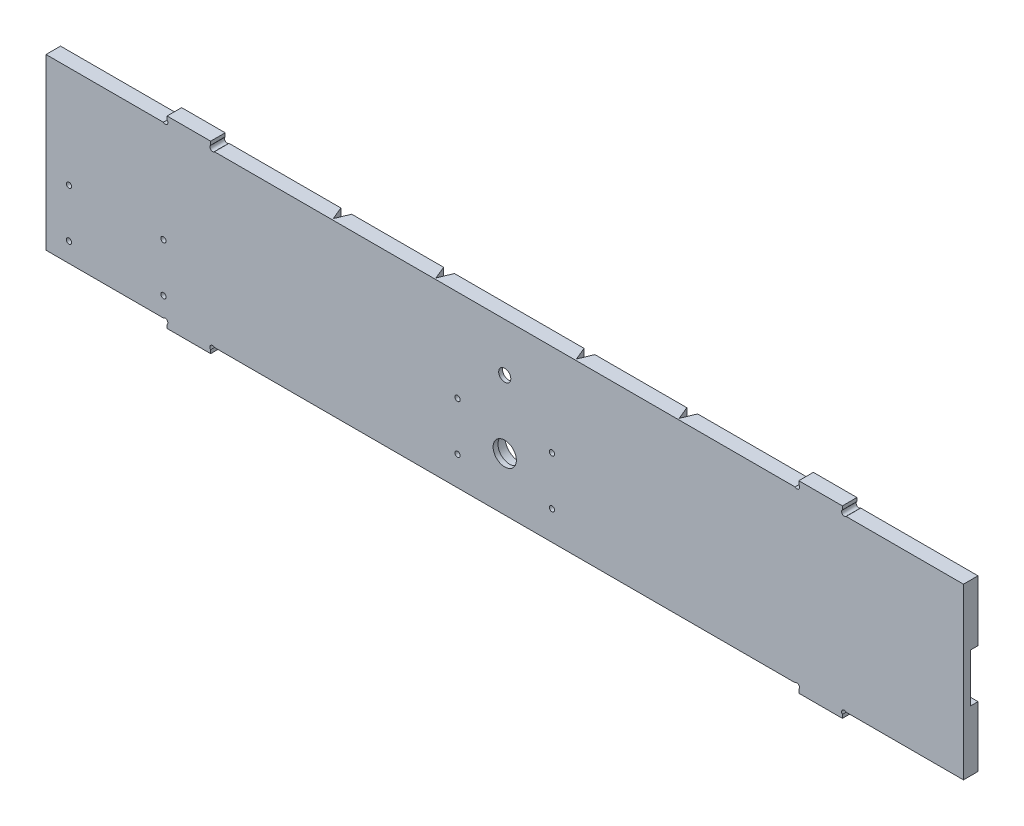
ISO-10303-21;
HEADER;
FILE_DESCRIPTION(('STEP AP214'),'2;1');
FILE_NAME('part.step','',(''),(''),'','','');
FILE_SCHEMA(('AUTOMOTIVE_DESIGN { 1 0 10303 214 1 1 1 1 }'));
ENDSEC;
DATA;
#1=APPLICATION_CONTEXT('core data for automotive mechanical design processes');
#2=APPLICATION_PROTOCOL_DEFINITION('international standard','automotive_design',2000,#1);
#3=PRODUCT_CONTEXT('',#1,'mechanical');
#4=PRODUCT('Part','Part','',(#3));
#5=PRODUCT_RELATED_PRODUCT_CATEGORY('part','',(#4));
#6=PRODUCT_DEFINITION_FORMATION('','',#4);
#7=PRODUCT_DEFINITION_CONTEXT('part definition',#1,'design');
#8=PRODUCT_DEFINITION('design','',#6,#7);
#9=PRODUCT_DEFINITION_SHAPE('','',#8);
#10=(LENGTH_UNIT() NAMED_UNIT(*) SI_UNIT(.MILLI.,.METRE.));
#11=(NAMED_UNIT(*) PLANE_ANGLE_UNIT() SI_UNIT($,.RADIAN.));
#12=(NAMED_UNIT(*) SI_UNIT($,.STERADIAN.) SOLID_ANGLE_UNIT());
#13=UNCERTAINTY_MEASURE_WITH_UNIT(LENGTH_MEASURE(1.E-05),#10,'distance_accuracy_value','');
#14=(GEOMETRIC_REPRESENTATION_CONTEXT(3) GLOBAL_UNCERTAINTY_ASSIGNED_CONTEXT((#13)) GLOBAL_UNIT_ASSIGNED_CONTEXT((#10,
#11,#12)) REPRESENTATION_CONTEXT('',''));
#15=CARTESIAN_POINT('',(0.,0.,0.));
#16=DIRECTION('',(0.,0.,1.));
#17=DIRECTION('',(1.,0.,0.));
#18=AXIS2_PLACEMENT_3D('',#15,#16,#17);
#19=CARTESIAN_POINT('',(189.43,53.,6.));
#20=DIRECTION('',(0.,0.,-1.));
#21=DIRECTION('',(-1.,0.,0.));
#22=AXIS2_PLACEMENT_3D('',#19,#20,#21);
#23=CYLINDRICAL_SURFACE('',#22,2.5);
#24=CARTESIAN_POINT('',(189.43,53.,6.));
#25=DIRECTION('',(0.,0.,1.));
#26=DIRECTION('',(1.,0.,0.));
#27=AXIS2_PLACEMENT_3D('',#24,#25,#26);
#28=CIRCLE('',#27,2.5);
#29=CARTESIAN_POINT('',(191.93,53.,6.));
#30=VERTEX_POINT('',#29);
#31=EDGE_CURVE('E569',#30,#30,#28,.T.);
#32=ORIENTED_EDGE('',*,*,#31,.T.);
#33=EDGE_LOOP('',(#32));
#34=FACE_BOUND('',#33,.T.);
#35=CARTESIAN_POINT('',(189.43,53.,4.4));
#36=DIRECTION('',(0.,0.,-1.));
#37=DIRECTION('',(-1.,0.,0.));
#38=AXIS2_PLACEMENT_3D('',#35,#36,#37);
#39=CIRCLE('',#38,2.5);
#40=CARTESIAN_POINT('',(186.93,53.,4.4));
#41=VERTEX_POINT('',#40);
#42=EDGE_CURVE('E37',#41,#41,#39,.T.);
#43=ORIENTED_EDGE('',*,*,#42,.T.);
#44=EDGE_LOOP('',(#43));
#45=FACE_BOUND('',#44,.T.);
#46=ADVANCED_FACE('F33',(#34,#45),#23,.F.);
#47=CARTESIAN_POINT('',(49.2221825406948,73.7778174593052,0.));
#48=DIRECTION('',(0.,0.,1.));
#49=DIRECTION('',(1.,0.,0.));
#50=AXIS2_PLACEMENT_3D('',#47,#48,#49);
#51=PLANE('',#50);
#52=CARTESIAN_POINT('',(48.5,11.,0.));
#53=DIRECTION('',(0.,0.,1.));
#54=DIRECTION('',(1.,0.,0.));
#55=AXIS2_PLACEMENT_3D('',#52,#53,#54);
#56=CIRCLE('',#55,1.1);
#57=CARTESIAN_POINT('',(49.6,11.,0.));
#58=VERTEX_POINT('',#57);
#59=EDGE_CURVE('E539',#58,#58,#56,.T.);
#60=ORIENTED_EDGE('',*,*,#59,.T.);
#61=EDGE_LOOP('',(#60));
#62=FACE_BOUND('',#61,.T.);
#63=CARTESIAN_POINT('',(9.49999999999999,11.,0.));
#64=DIRECTION('',(0.,0.,1.));
#65=DIRECTION('',(-1.,0.,0.));
#66=AXIS2_PLACEMENT_3D('',#63,#64,#65);
#67=CIRCLE('',#66,1.1);
#68=CARTESIAN_POINT('',(8.4,11.,0.));
#69=VERTEX_POINT('',#68);
#70=EDGE_CURVE('E533',#69,#69,#67,.T.);
#71=ORIENTED_EDGE('',*,*,#70,.T.);
#72=EDGE_LOOP('',(#71));
#73=FACE_BOUND('',#72,.T.);
#74=CARTESIAN_POINT('',(9.49999999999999,31.,0.));
#75=DIRECTION('',(0.,0.,1.));
#76=DIRECTION('',(1.,0.,0.));
#77=AXIS2_PLACEMENT_3D('',#74,#75,#76);
#78=CIRCLE('',#77,1.1);
#79=CARTESIAN_POINT('',(10.6,31.,0.));
#80=VERTEX_POINT('',#79);
#81=EDGE_CURVE('E526',#80,#80,#78,.T.);
#82=ORIENTED_EDGE('',*,*,#81,.T.);
#83=EDGE_LOOP('',(#82));
#84=FACE_BOUND('',#83,.T.);
#85=CARTESIAN_POINT('',(48.5,31.,0.));
#86=DIRECTION('',(0.,0.,1.));
#87=DIRECTION('',(-1.,0.,0.));
#88=AXIS2_PLACEMENT_3D('',#85,#86,#87);
#89=CIRCLE('',#88,1.1);
#90=CARTESIAN_POINT('',(47.4,31.,0.));
#91=VERTEX_POINT('',#90);
#92=EDGE_CURVE('E527',#91,#91,#89,.T.);
#93=ORIENTED_EDGE('',*,*,#92,.T.);
#94=EDGE_LOOP('',(#93));
#95=FACE_BOUND('',#94,.T.);
#96=DIRECTION('',(-1.,0.,0.));
#97=VECTOR('',#96,1.);
#98=CARTESIAN_POINT('',(69.5556349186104,73.,0.));
#99=LINE('',#98,#97);
#100=CARTESIAN_POINT('',(115.763246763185,73.,0.));
#101=VERTEX_POINT('',#100);
#102=CARTESIAN_POINT('',(69.5556349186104,73.,0.));
#103=VERTEX_POINT('',#102);
#104=EDGE_CURVE('E688',#101,#103,#99,.T.);
#105=ORIENTED_EDGE('',*,*,#104,.F.);
#106=DIRECTION('',(0.,-1.,0.));
#107=VECTOR('',#106,1.);
#108=CARTESIAN_POINT('',(115.763246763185,73.7778174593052,0.));
#109=LINE('',#108,#107);
#110=CARTESIAN_POINT('',(115.763246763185,3.00000000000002,0.));
#111=VERTEX_POINT('',#110);
#112=EDGE_CURVE('E388',#101,#111,#109,.T.);
#113=ORIENTED_EDGE('',*,*,#112,.T.);
#114=DIRECTION('',(1.,0.,0.));
#115=VECTOR('',#114,1.);
#116=CARTESIAN_POINT('',(69.5556349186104,3.,0.));
#117=LINE('',#116,#115);
#118=CARTESIAN_POINT('',(69.5556349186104,3.,0.));
#119=VERTEX_POINT('',#118);
#120=EDGE_CURVE('E379',#119,#111,#117,.T.);
#121=ORIENTED_EDGE('',*,*,#120,.F.);
#122=CARTESIAN_POINT('',(68.7778174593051,2.2221825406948,0.));
#123=DIRECTION('',(0.,0.,-1.));
#124=DIRECTION('',(1.,0.,0.));
#125=AXIS2_PLACEMENT_3D('',#122,#123,#124);
#126=CIRCLE('',#125,1.1);
#127=CARTESIAN_POINT('',(67.9999999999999,1.44436508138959,0.));
#128=VERTEX_POINT('',#127);
#129=EDGE_CURVE('E655',#128,#119,#126,.T.);
#130=ORIENTED_EDGE('',*,*,#129,.F.);
#131=DIRECTION('',(0.,1.,0.));
#132=VECTOR('',#131,1.);
#133=CARTESIAN_POINT('',(67.9999999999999,1.44436508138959,0.));
#134=LINE('',#133,#132);
#135=CARTESIAN_POINT('',(67.9999999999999,0.,0.));
#136=VERTEX_POINT('',#135);
#137=EDGE_CURVE('E653',#136,#128,#134,.T.);
#138=ORIENTED_EDGE('',*,*,#137,.F.);
#139=DIRECTION('',(1.,0.,0.));
#140=VECTOR('',#139,1.);
#141=CARTESIAN_POINT('',(50.,0.,0.));
#142=LINE('',#141,#140);
#143=CARTESIAN_POINT('',(50.,0.,0.));
#144=VERTEX_POINT('',#143);
#145=EDGE_CURVE('E651',#144,#136,#142,.T.);
#146=ORIENTED_EDGE('',*,*,#145,.F.);
#147=DIRECTION('',(0.,-1.,0.));
#148=VECTOR('',#147,1.);
#149=CARTESIAN_POINT('',(49.9999999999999,1.44436508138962,0.));
#150=LINE('',#149,#148);
#151=CARTESIAN_POINT('',(49.9999999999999,1.44436508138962,0.));
#152=VERTEX_POINT('',#151);
#153=EDGE_CURVE('E649',#152,#144,#150,.T.);
#154=ORIENTED_EDGE('',*,*,#153,.F.);
#155=CARTESIAN_POINT('',(49.2221825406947,2.22218254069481,0.));
#156=DIRECTION('',(0.,0.,-1.));
#157=DIRECTION('',(-1.,0.,0.));
#158=AXIS2_PLACEMENT_3D('',#155,#156,#157);
#159=CIRCLE('',#158,1.09999999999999);
#160=CARTESIAN_POINT('',(48.4443650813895,3.00000000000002,0.));
#161=VERTEX_POINT('',#160);
#162=EDGE_CURVE('E647',#161,#152,#159,.T.);
#163=ORIENTED_EDGE('',*,*,#162,.F.);
#164=DIRECTION('',(1.,0.,0.));
#165=VECTOR('',#164,1.);
#166=CARTESIAN_POINT('',(48.4443650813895,3.00000000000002,0.));
#167=LINE('',#166,#165);
#168=CARTESIAN_POINT('',(0.,3.00000000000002,0.));
#169=VERTEX_POINT('',#168);
#170=EDGE_CURVE('E645',#169,#161,#167,.T.);
#171=ORIENTED_EDGE('',*,*,#170,.F.);
#172=DIRECTION('',(0.,-1.,0.));
#173=VECTOR('',#172,1.);
#174=CARTESIAN_POINT('',(0.,73.,0.));
#175=LINE('',#174,#173);
#176=CARTESIAN_POINT('',(0.,28.,0.));
#177=VERTEX_POINT('',#176);
#178=EDGE_CURVE('E641',#177,#169,#175,.T.);
#179=ORIENTED_EDGE('',*,*,#178,.F.);
#180=DIRECTION('',(-1.,0.,0.));
#181=VECTOR('',#180,1.);
#182=CARTESIAN_POINT('',(0.,28.,0.));
#183=LINE('',#182,#181);
#184=CARTESIAN_POINT('',(3.73725830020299,28.,0.));
#185=VERTEX_POINT('',#184);
#186=EDGE_CURVE('E457',#185,#177,#183,.T.);
#187=ORIENTED_EDGE('',*,*,#186,.F.);
#188=CARTESIAN_POINT('',(4.8686291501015,29.1313708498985,0.));
#189=DIRECTION('',(0.,0.,-1.));
#190=DIRECTION('',(1.,0.,0.));
#191=AXIS2_PLACEMENT_3D('',#188,#189,#190);
#192=CIRCLE('',#191,1.60000000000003);
#193=CARTESIAN_POINT('',(6.00000000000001,30.2627416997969,0.));
#194=VERTEX_POINT('',#193);
#195=EDGE_CURVE('E454',#194,#185,#192,.T.);
#196=ORIENTED_EDGE('',*,*,#195,.F.);
#197=DIRECTION('',(0.,-1.,0.));
#198=VECTOR('',#197,1.);
#199=CARTESIAN_POINT('',(5.99999999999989,45.7372583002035,0.));
#200=LINE('',#199,#198);
#201=CARTESIAN_POINT('',(5.99999999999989,45.7372583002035,0.));
#202=VERTEX_POINT('',#201);
#203=EDGE_CURVE('E451',#202,#194,#200,.T.);
#204=ORIENTED_EDGE('',*,*,#203,.F.);
#205=CARTESIAN_POINT('',(4.86862915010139,46.8686291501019,0.));
#206=DIRECTION('',(0.,0.,-1.));
#207=DIRECTION('',(-1.,0.,0.));
#208=AXIS2_PLACEMENT_3D('',#205,#206,#207);
#209=CIRCLE('',#208,1.59999999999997);
#210=CARTESIAN_POINT('',(3.73725830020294,48.0000000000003,0.));
#211=VERTEX_POINT('',#210);
#212=EDGE_CURVE('E430',#211,#202,#209,.T.);
#213=ORIENTED_EDGE('',*,*,#212,.F.);
#214=DIRECTION('',(1.,0.,0.));
#215=VECTOR('',#214,1.);
#216=CARTESIAN_POINT('',(3.73725830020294,48.0000000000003,0.));
#217=LINE('',#216,#215);
#218=CARTESIAN_POINT('',(0.,48.0000000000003,0.));
#219=VERTEX_POINT('',#218);
#220=EDGE_CURVE('E435',#219,#211,#217,.T.);
#221=ORIENTED_EDGE('',*,*,#220,.F.);
#222=CARTESIAN_POINT('',(0.,73.,0.));
#223=VERTEX_POINT('',#222);
#224=EDGE_CURVE('E642',#223,#219,#175,.T.);
#225=ORIENTED_EDGE('',*,*,#224,.F.);
#226=DIRECTION('',(-1.,0.,0.));
#227=VECTOR('',#226,1.);
#228=CARTESIAN_POINT('',(48.4443650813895,73.,0.));
#229=LINE('',#228,#227);
#230=CARTESIAN_POINT('',(48.4443650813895,73.,0.));
#231=VERTEX_POINT('',#230);
#232=EDGE_CURVE('E639',#231,#223,#229,.T.);
#233=ORIENTED_EDGE('',*,*,#232,.F.);
#234=CARTESIAN_POINT('',(49.2221825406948,73.7778174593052,0.));
#235=DIRECTION('',(0.,0.,-1.));
#236=DIRECTION('',(1.,0.,0.));
#237=AXIS2_PLACEMENT_3D('',#234,#235,#236);
#238=CIRCLE('',#237,1.10000000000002);
#239=CARTESIAN_POINT('',(50.,74.5556349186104,0.));
#240=VERTEX_POINT('',#239);
#241=EDGE_CURVE('E577',#240,#231,#238,.T.);
#242=ORIENTED_EDGE('',*,*,#241,.F.);
#243=DIRECTION('',(0.,-1.,0.));
#244=VECTOR('',#243,1.);
#245=CARTESIAN_POINT('',(50.,74.5556349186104,0.));
#246=LINE('',#245,#244);
#247=CARTESIAN_POINT('',(50.,76.,0.));
#248=VERTEX_POINT('',#247);
#249=EDGE_CURVE('E582',#248,#240,#246,.T.);
#250=ORIENTED_EDGE('',*,*,#249,.F.);
#251=DIRECTION('',(-1.,0.,0.));
#252=VECTOR('',#251,1.);
#253=CARTESIAN_POINT('',(50.,76.,0.));
#254=LINE('',#253,#252);
#255=CARTESIAN_POINT('',(68.,76.,0.));
#256=VERTEX_POINT('',#255);
#257=EDGE_CURVE('E697',#256,#248,#254,.T.);
#258=ORIENTED_EDGE('',*,*,#257,.F.);
#259=DIRECTION('',(0.,1.,0.));
#260=VECTOR('',#259,1.);
#261=CARTESIAN_POINT('',(68.,74.5556349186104,0.));
#262=LINE('',#261,#260);
#263=CARTESIAN_POINT('',(68.,74.5556349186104,0.));
#264=VERTEX_POINT('',#263);
#265=EDGE_CURVE('E695',#264,#256,#262,.T.);
#266=ORIENTED_EDGE('',*,*,#265,.F.);
#267=CARTESIAN_POINT('',(68.7778174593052,73.7778174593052,0.));
#268=DIRECTION('',(0.,0.,-1.));
#269=DIRECTION('',(-1.,0.,0.));
#270=AXIS2_PLACEMENT_3D('',#267,#268,#269);
#271=CIRCLE('',#270,1.1);
#272=EDGE_CURVE('E692',#103,#264,#271,.T.);
#273=ORIENTED_EDGE('',*,*,#272,.F.);
#274=EDGE_LOOP('',(#105,#113,#121,#130,#138,#146,#154,#163,#171,#179,#187,#196,#204,#213,#221,
#225,#233,#242,#250,#258,#266,#273));
#275=FACE_BOUND('',#274,.T.);
#276=ADVANCED_FACE('F851',(#62,#73,#84,#95,#275),#51,.F.);
#277=CARTESIAN_POINT('',(120.236753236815,3.00000000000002,0.));
#278=VERTEX_POINT('',#277);
#279=CARTESIAN_POINT('',(158.193246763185,3.00000000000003,0.));
#280=VERTEX_POINT('',#279);
#281=EDGE_CURVE('E660',#278,#280,#117,.T.);
#282=ORIENTED_EDGE('',*,*,#281,.F.);
#283=DIRECTION('',(0.,1.,0.));
#284=VECTOR('',#283,1.);
#285=CARTESIAN_POINT('',(120.236753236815,73.7778174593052,0.));
#286=LINE('',#285,#284);
#287=CARTESIAN_POINT('',(120.236753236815,73.,0.));
#288=VERTEX_POINT('',#287);
#289=EDGE_CURVE('E366',#278,#288,#286,.T.);
#290=ORIENTED_EDGE('',*,*,#289,.T.);
#291=CARTESIAN_POINT('',(158.193246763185,73.,0.));
#292=VERTEX_POINT('',#291);
#293=EDGE_CURVE('E807',#292,#288,#99,.T.);
#294=ORIENTED_EDGE('',*,*,#293,.F.);
#295=DIRECTION('',(0.,-1.,0.));
#296=VECTOR('',#295,1.);
#297=CARTESIAN_POINT('',(158.193246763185,73.7778174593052,0.));
#298=LINE('',#297,#296);
#299=EDGE_CURVE('E399',#292,#280,#298,.T.);
#300=ORIENTED_EDGE('',*,*,#299,.T.);
#301=EDGE_LOOP('',(#282,#290,#294,#300));
#302=FACE_BOUND('',#301,.T.);
#303=ADVANCED_FACE('F809',(#302),#51,.F.);
#304=CARTESIAN_POINT('',(189.43,53.,0.));
#305=DIRECTION('',(0.,0.,-1.));
#306=DIRECTION('',(-1.,0.,0.));
#307=AXIS2_PLACEMENT_3D('',#304,#305,#306);
#308=CIRCLE('',#307,12.);
#309=CARTESIAN_POINT('',(177.43,53.,0.));
#310=VERTEX_POINT('',#309);
#311=EDGE_CURVE('E384',#310,#310,#308,.T.);
#312=ORIENTED_EDGE('',*,*,#311,.F.);
#313=EDGE_LOOP('',(#312));
#314=FACE_BOUND('',#313,.T.);
#315=CARTESIAN_POINT('',(189.43,25.,0.));
#316=DIRECTION('',(0.,0.,-1.));
#317=DIRECTION('',(-1.,0.,0.));
#318=AXIS2_PLACEMENT_3D('',#315,#316,#317);
#319=CIRCLE('',#318,5.95000000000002);
#320=CARTESIAN_POINT('',(183.48,25.,0.));
#321=VERTEX_POINT('',#320);
#322=EDGE_CURVE('E506',#321,#321,#319,.T.);
#323=ORIENTED_EDGE('',*,*,#322,.F.);
#324=EDGE_LOOP('',(#323));
#325=FACE_BOUND('',#324,.T.);
#326=CARTESIAN_POINT('',(208.93,15.,0.));
#327=DIRECTION('',(0.,0.,1.));
#328=DIRECTION('',(1.,0.,0.));
#329=AXIS2_PLACEMENT_3D('',#326,#327,#328);
#330=CIRCLE('',#329,1.09999999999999);
#331=CARTESIAN_POINT('',(210.03,15.,0.));
#332=VERTEX_POINT('',#331);
#333=EDGE_CURVE('E563',#332,#332,#330,.T.);
#334=ORIENTED_EDGE('',*,*,#333,.T.);
#335=EDGE_LOOP('',(#334));
#336=FACE_BOUND('',#335,.T.);
#337=CARTESIAN_POINT('',(169.93,15.,0.));
#338=DIRECTION('',(0.,0.,1.));
#339=DIRECTION('',(-1.,0.,0.));
#340=AXIS2_PLACEMENT_3D('',#337,#338,#339);
#341=CIRCLE('',#340,1.09999999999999);
#342=CARTESIAN_POINT('',(168.83,15.,0.));
#343=VERTEX_POINT('',#342);
#344=EDGE_CURVE('E557',#343,#343,#341,.T.);
#345=ORIENTED_EDGE('',*,*,#344,.T.);
#346=EDGE_LOOP('',(#345));
#347=FACE_BOUND('',#346,.T.);
#348=CARTESIAN_POINT('',(208.93,35.,0.));
#349=DIRECTION('',(0.,0.,1.));
#350=DIRECTION('',(-1.,0.,0.));
#351=AXIS2_PLACEMENT_3D('',#348,#349,#350);
#352=CIRCLE('',#351,1.09999999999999);
#353=CARTESIAN_POINT('',(207.83,35.,0.));
#354=VERTEX_POINT('',#353);
#355=EDGE_CURVE('E551',#354,#354,#352,.T.);
#356=ORIENTED_EDGE('',*,*,#355,.T.);
#357=EDGE_LOOP('',(#356));
#358=FACE_BOUND('',#357,.T.);
#359=CARTESIAN_POINT('',(169.93,35.,0.));
#360=DIRECTION('',(0.,0.,1.));
#361=DIRECTION('',(1.,0.,0.));
#362=AXIS2_PLACEMENT_3D('',#359,#360,#361);
#363=CIRCLE('',#362,1.09999999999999);
#364=CARTESIAN_POINT('',(171.03,35.,0.));
#365=VERTEX_POINT('',#364);
#366=EDGE_CURVE('E545',#365,#365,#363,.T.);
#367=ORIENTED_EDGE('',*,*,#366,.T.);
#368=EDGE_LOOP('',(#367));
#369=FACE_BOUND('',#368,.T.);
#370=CARTESIAN_POINT('',(162.666753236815,3.00000000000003,0.));
#371=VERTEX_POINT('',#370);
#372=CARTESIAN_POINT('',(216.193246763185,3.00000000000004,0.));
#373=VERTEX_POINT('',#372);
#374=EDGE_CURVE('E811',#371,#373,#117,.T.);
#375=ORIENTED_EDGE('',*,*,#374,.F.);
#376=DIRECTION('',(0.,1.,0.));
#377=VECTOR('',#376,1.);
#378=CARTESIAN_POINT('',(162.666753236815,73.7778174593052,0.));
#379=LINE('',#378,#377);
#380=CARTESIAN_POINT('',(162.666753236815,73.,0.));
#381=VERTEX_POINT('',#380);
#382=EDGE_CURVE('E396',#371,#381,#379,.T.);
#383=ORIENTED_EDGE('',*,*,#382,.T.);
#384=CARTESIAN_POINT('',(216.193246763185,73.,0.));
#385=VERTEX_POINT('',#384);
#386=EDGE_CURVE('E856',#385,#381,#99,.T.);
#387=ORIENTED_EDGE('',*,*,#386,.F.);
#388=DIRECTION('',(0.,-1.,0.));
#389=VECTOR('',#388,1.);
#390=CARTESIAN_POINT('',(216.193246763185,73.7778174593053,0.));
#391=LINE('',#390,#389);
#392=EDGE_CURVE('E413',#385,#373,#391,.T.);
#393=ORIENTED_EDGE('',*,*,#392,.T.);
#394=EDGE_LOOP('',(#375,#383,#387,#393));
#395=FACE_BOUND('',#394,.T.);
#396=ADVANCED_FACE('F870',(#314,#325,#336,#347,#358,#369,#395),#51,.F.);
#397=CARTESIAN_POINT('',(220.666753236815,3.00000000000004,0.));
#398=VERTEX_POINT('',#397);
#399=CARTESIAN_POINT('',(258.623246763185,3.00000000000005,0.));
#400=VERTEX_POINT('',#399);
#401=EDGE_CURVE('E812',#398,#400,#117,.T.);
#402=ORIENTED_EDGE('',*,*,#401,.F.);
#403=DIRECTION('',(0.,1.,0.));
#404=VECTOR('',#403,1.);
#405=CARTESIAN_POINT('',(220.666753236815,73.7778174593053,0.));
#406=LINE('',#405,#404);
#407=CARTESIAN_POINT('',(220.666753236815,73.,0.));
#408=VERTEX_POINT('',#407);
#409=EDGE_CURVE('E410',#398,#408,#406,.T.);
#410=ORIENTED_EDGE('',*,*,#409,.T.);
#411=CARTESIAN_POINT('',(258.623246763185,73.,0.));
#412=VERTEX_POINT('',#411);
#413=EDGE_CURVE('E693',#412,#408,#99,.T.);
#414=ORIENTED_EDGE('',*,*,#413,.F.);
#415=DIRECTION('',(0.,-1.,0.));
#416=VECTOR('',#415,1.);
#417=CARTESIAN_POINT('',(258.623246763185,73.7778174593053,0.));
#418=LINE('',#417,#416);
#419=EDGE_CURVE('E427',#412,#400,#418,.T.);
#420=ORIENTED_EDGE('',*,*,#419,.T.);
#421=EDGE_LOOP('',(#402,#410,#414,#420));
#422=FACE_BOUND('',#421,.T.);
#423=ADVANCED_FACE('F863',(#422),#51,.F.);
#424=CARTESIAN_POINT('',(189.43,25.,6.));
#425=DIRECTION('',(0.,0.,-1.));
#426=DIRECTION('',(-1.,0.,0.));
#427=AXIS2_PLACEMENT_3D('',#424,#425,#426);
#428=CYLINDRICAL_SURFACE('',#427,4.8);
#429=CARTESIAN_POINT('',(189.43,25.,6.));
#430=DIRECTION('',(0.,0.,1.));
#431=DIRECTION('',(1.,0.,0.));
#432=AXIS2_PLACEMENT_3D('',#429,#430,#431);
#433=CIRCLE('',#432,4.8);
#434=CARTESIAN_POINT('',(194.23,25.,6.));
#435=VERTEX_POINT('',#434);
#436=EDGE_CURVE('E574',#435,#435,#433,.T.);
#437=ORIENTED_EDGE('',*,*,#436,.T.);
#438=EDGE_LOOP('',(#437));
#439=FACE_BOUND('',#438,.T.);
#440=CARTESIAN_POINT('',(189.43,25.,4.));
#441=DIRECTION('',(0.,0.,-1.));
#442=DIRECTION('',(-1.,0.,0.));
#443=AXIS2_PLACEMENT_3D('',#440,#441,#442);
#444=CIRCLE('',#443,4.8);
#445=CARTESIAN_POINT('',(184.63,25.,4.));
#446=VERTEX_POINT('',#445);
#447=EDGE_CURVE('E520',#446,#446,#444,.T.);
#448=ORIENTED_EDGE('',*,*,#447,.T.);
#449=EDGE_LOOP('',(#448));
#450=FACE_BOUND('',#449,.T.);
#451=ADVANCED_FACE('F895',(#439,#450),#428,.F.);
#452=CARTESIAN_POINT('',(49.2221825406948,73.7778174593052,6.));
#453=DIRECTION('',(0.,0.,1.));
#454=DIRECTION('',(1.,0.,0.));
#455=AXIS2_PLACEMENT_3D('',#452,#453,#454);
#456=PLANE('',#455);
#457=CARTESIAN_POINT('',(9.49999999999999,31.,6.));
#458=DIRECTION('',(0.,0.,1.));
#459=DIRECTION('',(1.,0.,0.));
#460=AXIS2_PLACEMENT_3D('',#457,#458,#459);
#461=CIRCLE('',#460,1.1);
#462=CARTESIAN_POINT('',(10.6,31.,6.));
#463=VERTEX_POINT('',#462);
#464=EDGE_CURVE('E530',#463,#463,#461,.T.);
#465=ORIENTED_EDGE('',*,*,#464,.F.);
#466=EDGE_LOOP('',(#465));
#467=FACE_BOUND('',#466,.T.);
#468=CARTESIAN_POINT('',(48.5,11.,6.));
#469=DIRECTION('',(0.,0.,1.));
#470=DIRECTION('',(1.,0.,0.));
#471=AXIS2_PLACEMENT_3D('',#468,#469,#470);
#472=CIRCLE('',#471,1.1);
#473=CARTESIAN_POINT('',(49.6,11.,6.));
#474=VERTEX_POINT('',#473);
#475=EDGE_CURVE('E542',#474,#474,#472,.T.);
#476=ORIENTED_EDGE('',*,*,#475,.F.);
#477=EDGE_LOOP('',(#476));
#478=FACE_BOUND('',#477,.T.);
#479=CARTESIAN_POINT('',(208.93,35.,6.));
#480=DIRECTION('',(0.,0.,1.));
#481=DIRECTION('',(-1.,0.,0.));
#482=AXIS2_PLACEMENT_3D('',#479,#480,#481);
#483=CIRCLE('',#482,1.09999999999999);
#484=CARTESIAN_POINT('',(207.83,35.,6.));
#485=VERTEX_POINT('',#484);
#486=EDGE_CURVE('E554',#485,#485,#483,.T.);
#487=ORIENTED_EDGE('',*,*,#486,.F.);
#488=EDGE_LOOP('',(#487));
#489=FACE_BOUND('',#488,.T.);
#490=CARTESIAN_POINT('',(208.93,15.,6.));
#491=DIRECTION('',(0.,0.,1.));
#492=DIRECTION('',(1.,0.,0.));
#493=AXIS2_PLACEMENT_3D('',#490,#491,#492);
#494=CIRCLE('',#493,1.09999999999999);
#495=CARTESIAN_POINT('',(210.03,15.,6.));
#496=VERTEX_POINT('',#495);
#497=EDGE_CURVE('E566',#496,#496,#494,.T.);
#498=ORIENTED_EDGE('',*,*,#497,.F.);
#499=EDGE_LOOP('',(#498));
#500=FACE_BOUND('',#499,.T.);
#501=ORIENTED_EDGE('',*,*,#436,.F.);
#502=EDGE_LOOP('',(#501));
#503=FACE_BOUND('',#502,.T.);
#504=CARTESIAN_POINT('',(49.2221825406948,73.7778174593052,6.));
#505=DIRECTION('',(0.,0.,-1.));
#506=DIRECTION('',(1.,0.,0.));
#507=AXIS2_PLACEMENT_3D('',#504,#505,#506);
#508=CIRCLE('',#507,1.10000000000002);
#509=CARTESIAN_POINT('',(50.,74.5556349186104,6.));
#510=VERTEX_POINT('',#509);
#511=CARTESIAN_POINT('',(48.4443650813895,73.,6.));
#512=VERTEX_POINT('',#511);
#513=EDGE_CURVE('E578',#510,#512,#508,.T.);
#514=ORIENTED_EDGE('',*,*,#513,.T.);
#515=DIRECTION('',(-1.,0.,0.));
#516=VECTOR('',#515,1.);
#517=CARTESIAN_POINT('',(48.4443650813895,73.,6.));
#518=LINE('',#517,#516);
#519=CARTESIAN_POINT('',(0.,73.,6.));
#520=VERTEX_POINT('',#519);
#521=EDGE_CURVE('E581',#512,#520,#518,.T.);
#522=ORIENTED_EDGE('',*,*,#521,.T.);
#523=DIRECTION('',(0.,-1.,0.));
#524=VECTOR('',#523,1.);
#525=CARTESIAN_POINT('',(0.,73.,6.));
#526=LINE('',#525,#524);
#527=CARTESIAN_POINT('',(0.,3.00000000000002,6.));
#528=VERTEX_POINT('',#527);
#529=EDGE_CURVE('E584',#520,#528,#526,.T.);
#530=ORIENTED_EDGE('',*,*,#529,.T.);
#531=DIRECTION('',(1.,0.,0.));
#532=VECTOR('',#531,1.);
#533=CARTESIAN_POINT('',(48.4443650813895,3.00000000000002,6.));
#534=LINE('',#533,#532);
#535=CARTESIAN_POINT('',(48.4443650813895,3.00000000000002,6.));
#536=VERTEX_POINT('',#535);
#537=EDGE_CURVE('E586',#528,#536,#534,.T.);
#538=ORIENTED_EDGE('',*,*,#537,.T.);
#539=CARTESIAN_POINT('',(49.2221825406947,2.22218254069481,6.));
#540=DIRECTION('',(0.,0.,-1.));
#541=DIRECTION('',(-1.,0.,0.));
#542=AXIS2_PLACEMENT_3D('',#539,#540,#541);
#543=CIRCLE('',#542,1.09999999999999);
#544=CARTESIAN_POINT('',(49.9999999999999,1.44436508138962,6.));
#545=VERTEX_POINT('',#544);
#546=EDGE_CURVE('E588',#536,#545,#543,.T.);
#547=ORIENTED_EDGE('',*,*,#546,.T.);
#548=DIRECTION('',(0.,-1.,0.));
#549=VECTOR('',#548,1.);
#550=CARTESIAN_POINT('',(49.9999999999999,1.44436508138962,6.));
#551=LINE('',#550,#549);
#552=CARTESIAN_POINT('',(50.,0.,6.));
#553=VERTEX_POINT('',#552);
#554=EDGE_CURVE('E590',#545,#553,#551,.T.);
#555=ORIENTED_EDGE('',*,*,#554,.T.);
#556=DIRECTION('',(1.,0.,0.));
#557=VECTOR('',#556,1.);
#558=CARTESIAN_POINT('',(50.,0.,6.));
#559=LINE('',#558,#557);
#560=CARTESIAN_POINT('',(67.9999999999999,0.,6.));
#561=VERTEX_POINT('',#560);
#562=EDGE_CURVE('E592',#553,#561,#559,.T.);
#563=ORIENTED_EDGE('',*,*,#562,.T.);
#564=DIRECTION('',(0.,1.,0.));
#565=VECTOR('',#564,1.);
#566=CARTESIAN_POINT('',(67.9999999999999,1.44436508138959,6.));
#567=LINE('',#566,#565);
#568=CARTESIAN_POINT('',(67.9999999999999,1.44436508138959,6.));
#569=VERTEX_POINT('',#568);
#570=EDGE_CURVE('E594',#561,#569,#567,.T.);
#571=ORIENTED_EDGE('',*,*,#570,.T.);
#572=CARTESIAN_POINT('',(68.7778174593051,2.2221825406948,6.));
#573=DIRECTION('',(0.,0.,-1.));
#574=DIRECTION('',(1.,0.,0.));
#575=AXIS2_PLACEMENT_3D('',#572,#573,#574);
#576=CIRCLE('',#575,1.1);
#577=CARTESIAN_POINT('',(69.5556349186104,3.,6.));
#578=VERTEX_POINT('',#577);
#579=EDGE_CURVE('E596',#569,#578,#576,.T.);
#580=ORIENTED_EDGE('',*,*,#579,.T.);
#581=DIRECTION('',(1.,0.,0.));
#582=VECTOR('',#581,1.);
#583=CARTESIAN_POINT('',(69.5556349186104,3.,6.));
#584=LINE('',#583,#582);
#585=CARTESIAN_POINT('',(309.30436508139,3.00000000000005,6.));
#586=VERTEX_POINT('',#585);
#587=EDGE_CURVE('E598',#578,#586,#584,.T.);
#588=ORIENTED_EDGE('',*,*,#587,.T.);
#589=CARTESIAN_POINT('',(310.082182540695,2.22218254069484,6.));
#590=DIRECTION('',(0.,0.,-1.));
#591=DIRECTION('',(-1.,0.,0.));
#592=AXIS2_PLACEMENT_3D('',#589,#590,#591);
#593=CIRCLE('',#592,1.1);
#594=CARTESIAN_POINT('',(310.86,1.44436508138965,6.));
#595=VERTEX_POINT('',#594);
#596=EDGE_CURVE('E600',#586,#595,#593,.T.);
#597=ORIENTED_EDGE('',*,*,#596,.T.);
#598=DIRECTION('',(0.,-1.,0.));
#599=VECTOR('',#598,1.);
#600=CARTESIAN_POINT('',(310.86,1.44436508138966,6.));
#601=LINE('',#600,#599);
#602=CARTESIAN_POINT('',(310.86,0.,6.));
#603=VERTEX_POINT('',#602);
#604=EDGE_CURVE('E602',#595,#603,#601,.T.);
#605=ORIENTED_EDGE('',*,*,#604,.T.);
#606=DIRECTION('',(1.,0.,0.));
#607=VECTOR('',#606,1.);
#608=CARTESIAN_POINT('',(328.86,0.,6.));
#609=LINE('',#608,#607);
#610=CARTESIAN_POINT('',(328.86,0.,6.));
#611=VERTEX_POINT('',#610);
#612=EDGE_CURVE('E604',#603,#611,#609,.T.);
#613=ORIENTED_EDGE('',*,*,#612,.T.);
#614=DIRECTION('',(0.,1.,0.));
#615=VECTOR('',#614,1.);
#616=CARTESIAN_POINT('',(328.86,1.44436508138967,6.));
#617=LINE('',#616,#615);
#618=CARTESIAN_POINT('',(328.86,1.44436508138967,6.));
#619=VERTEX_POINT('',#618);
#620=EDGE_CURVE('E606',#611,#619,#617,.T.);
#621=ORIENTED_EDGE('',*,*,#620,.T.);
#622=CARTESIAN_POINT('',(329.637817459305,2.22218254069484,6.));
#623=DIRECTION('',(0.,0.,-1.));
#624=DIRECTION('',(1.,0.,0.));
#625=AXIS2_PLACEMENT_3D('',#622,#623,#624);
#626=CIRCLE('',#625,1.09999999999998);
#627=CARTESIAN_POINT('',(330.41563491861,3.00000000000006,6.));
#628=VERTEX_POINT('',#627);
#629=EDGE_CURVE('E608',#619,#628,#626,.T.);
#630=ORIENTED_EDGE('',*,*,#629,.T.);
#631=DIRECTION('',(1.,0.,0.));
#632=VECTOR('',#631,1.);
#633=CARTESIAN_POINT('',(330.41563491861,3.00000000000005,6.));
#634=LINE('',#633,#632);
#635=CARTESIAN_POINT('',(378.86,3.00000000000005,6.));
#636=VERTEX_POINT('',#635);
#637=EDGE_CURVE('E610',#628,#636,#634,.T.);
#638=ORIENTED_EDGE('',*,*,#637,.T.);
#639=DIRECTION('',(0.,1.,0.));
#640=VECTOR('',#639,1.);
#641=CARTESIAN_POINT('',(378.86,72.9999999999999,6.));
#642=LINE('',#641,#640);
#643=CARTESIAN_POINT('',(378.86,72.9999999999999,6.));
#644=VERTEX_POINT('',#643);
#645=EDGE_CURVE('E612',#636,#644,#642,.T.);
#646=ORIENTED_EDGE('',*,*,#645,.T.);
#647=DIRECTION('',(-1.,0.,0.));
#648=VECTOR('',#647,1.);
#649=CARTESIAN_POINT('',(330.41563491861,72.9999999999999,6.));
#650=LINE('',#649,#648);
#651=CARTESIAN_POINT('',(330.41563491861,72.9999999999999,6.));
#652=VERTEX_POINT('',#651);
#653=EDGE_CURVE('E614',#644,#652,#650,.T.);
#654=ORIENTED_EDGE('',*,*,#653,.T.);
#655=CARTESIAN_POINT('',(329.637817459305,73.7778174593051,6.));
#656=DIRECTION('',(0.,0.,-1.));
#657=DIRECTION('',(-1.,0.,0.));
#658=AXIS2_PLACEMENT_3D('',#655,#656,#657);
#659=CIRCLE('',#658,1.09999999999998);
#660=CARTESIAN_POINT('',(328.86,74.5556349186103,6.));
#661=VERTEX_POINT('',#660);
#662=EDGE_CURVE('E616',#652,#661,#659,.T.);
#663=ORIENTED_EDGE('',*,*,#662,.T.);
#664=DIRECTION('',(0.,1.,0.));
#665=VECTOR('',#664,1.);
#666=CARTESIAN_POINT('',(328.86,74.5556349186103,6.));
#667=LINE('',#666,#665);
#668=CARTESIAN_POINT('',(328.86,76.,6.));
#669=VERTEX_POINT('',#668);
#670=EDGE_CURVE('E618',#661,#669,#667,.T.);
#671=ORIENTED_EDGE('',*,*,#670,.T.);
#672=DIRECTION('',(-1.,0.,0.));
#673=VECTOR('',#672,1.);
#674=CARTESIAN_POINT('',(328.86,76.,6.));
#675=LINE('',#674,#673);
#676=CARTESIAN_POINT('',(310.86,76.,6.));
#677=VERTEX_POINT('',#676);
#678=EDGE_CURVE('E620',#669,#677,#675,.T.);
#679=ORIENTED_EDGE('',*,*,#678,.T.);
#680=DIRECTION('',(0.,-1.,0.));
#681=VECTOR('',#680,1.);
#682=CARTESIAN_POINT('',(310.86,74.5556349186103,6.));
#683=LINE('',#682,#681);
#684=CARTESIAN_POINT('',(310.86,74.5556349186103,6.));
#685=VERTEX_POINT('',#684);
#686=EDGE_CURVE('E622',#677,#685,#683,.T.);
#687=ORIENTED_EDGE('',*,*,#686,.T.);
#688=CARTESIAN_POINT('',(310.082182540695,73.7778174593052,6.));
#689=DIRECTION('',(0.,0.,-1.));
#690=DIRECTION('',(1.,0.,0.));
#691=AXIS2_PLACEMENT_3D('',#688,#689,#690);
#692=CIRCLE('',#691,1.1);
#693=CARTESIAN_POINT('',(309.30436508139,73.,6.));
#694=VERTEX_POINT('',#693);
#695=EDGE_CURVE('E624',#685,#694,#692,.T.);
#696=ORIENTED_EDGE('',*,*,#695,.T.);
#697=DIRECTION('',(-1.,0.,0.));
#698=VECTOR('',#697,1.);
#699=CARTESIAN_POINT('',(69.5556349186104,73.,6.));
#700=LINE('',#699,#698);
#701=CARTESIAN_POINT('',(69.5556349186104,73.,6.));
#702=VERTEX_POINT('',#701);
#703=EDGE_CURVE('E626',#694,#702,#700,.T.);
#704=ORIENTED_EDGE('',*,*,#703,.T.);
#705=CARTESIAN_POINT('',(68.7778174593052,73.7778174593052,6.));
#706=DIRECTION('',(0.,0.,-1.));
#707=DIRECTION('',(-1.,0.,0.));
#708=AXIS2_PLACEMENT_3D('',#705,#706,#707);
#709=CIRCLE('',#708,1.1);
#710=CARTESIAN_POINT('',(68.,74.5556349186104,6.));
#711=VERTEX_POINT('',#710);
#712=EDGE_CURVE('E628',#702,#711,#709,.T.);
#713=ORIENTED_EDGE('',*,*,#712,.T.);
#714=DIRECTION('',(0.,1.,0.));
#715=VECTOR('',#714,1.);
#716=CARTESIAN_POINT('',(68.,74.5556349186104,6.));
#717=LINE('',#716,#715);
#718=CARTESIAN_POINT('',(68.,76.,6.));
#719=VERTEX_POINT('',#718);
#720=EDGE_CURVE('E630',#711,#719,#717,.T.);
#721=ORIENTED_EDGE('',*,*,#720,.T.);
#722=DIRECTION('',(-1.,0.,0.));
#723=VECTOR('',#722,1.);
#724=CARTESIAN_POINT('',(50.,76.,6.));
#725=LINE('',#724,#723);
#726=CARTESIAN_POINT('',(50.,76.,6.));
#727=VERTEX_POINT('',#726);
#728=EDGE_CURVE('E632',#719,#727,#725,.T.);
#729=ORIENTED_EDGE('',*,*,#728,.T.);
#730=DIRECTION('',(0.,-1.,0.));
#731=VECTOR('',#730,1.);
#732=CARTESIAN_POINT('',(50.,74.5556349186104,6.));
#733=LINE('',#732,#731);
#734=EDGE_CURVE('E634',#727,#510,#733,.T.);
#735=ORIENTED_EDGE('',*,*,#734,.T.);
#736=EDGE_LOOP('',(#514,#522,#530,#538,#547,#555,#563,#571,#580,#588,#597,#605,#613,#621,#630,
#638,#646,#654,#663,#671,#679,#687,#696,#704,#713,#721,#729,#735));
#737=FACE_BOUND('',#736,.T.);
#738=ORIENTED_EDGE('',*,*,#31,.F.);
#739=EDGE_LOOP('',(#738));
#740=FACE_BOUND('',#739,.T.);
#741=CARTESIAN_POINT('',(169.93,15.,6.));
#742=DIRECTION('',(0.,0.,1.));
#743=DIRECTION('',(-1.,0.,0.));
#744=AXIS2_PLACEMENT_3D('',#741,#742,#743);
#745=CIRCLE('',#744,1.09999999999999);
#746=CARTESIAN_POINT('',(168.83,15.,6.));
#747=VERTEX_POINT('',#746);
#748=EDGE_CURVE('E560',#747,#747,#745,.T.);
#749=ORIENTED_EDGE('',*,*,#748,.F.);
#750=EDGE_LOOP('',(#749));
#751=FACE_BOUND('',#750,.T.);
#752=CARTESIAN_POINT('',(169.93,35.,6.));
#753=DIRECTION('',(0.,0.,1.));
#754=DIRECTION('',(1.,0.,0.));
#755=AXIS2_PLACEMENT_3D('',#752,#753,#754);
#756=CIRCLE('',#755,1.09999999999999);
#757=CARTESIAN_POINT('',(171.03,35.,6.));
#758=VERTEX_POINT('',#757);
#759=EDGE_CURVE('E548',#758,#758,#756,.T.);
#760=ORIENTED_EDGE('',*,*,#759,.F.);
#761=EDGE_LOOP('',(#760));
#762=FACE_BOUND('',#761,.T.);
#763=CARTESIAN_POINT('',(9.49999999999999,11.,6.));
#764=DIRECTION('',(0.,0.,1.));
#765=DIRECTION('',(-1.,0.,0.));
#766=AXIS2_PLACEMENT_3D('',#763,#764,#765);
#767=CIRCLE('',#766,1.1);
#768=CARTESIAN_POINT('',(8.4,11.,6.));
#769=VERTEX_POINT('',#768);
#770=EDGE_CURVE('E536',#769,#769,#767,.T.);
#771=ORIENTED_EDGE('',*,*,#770,.F.);
#772=EDGE_LOOP('',(#771));
#773=FACE_BOUND('',#772,.T.);
#774=CARTESIAN_POINT('',(48.5,31.,6.));
#775=DIRECTION('',(0.,0.,1.));
#776=DIRECTION('',(-1.,0.,0.));
#777=AXIS2_PLACEMENT_3D('',#774,#775,#776);
#778=CIRCLE('',#777,1.1);
#779=CARTESIAN_POINT('',(47.4,31.,6.));
#780=VERTEX_POINT('',#779);
#781=EDGE_CURVE('E523',#780,#780,#778,.T.);
#782=ORIENTED_EDGE('',*,*,#781,.F.);
#783=EDGE_LOOP('',(#782));
#784=FACE_BOUND('',#783,.T.);
#785=ADVANCED_FACE('F843',(#467,#478,#489,#500,#503,#737,#740,#751,#762,#773,#784),#456,.T.);
#786=CARTESIAN_POINT('',(263.096753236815,3.00000000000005,0.));
#787=VERTEX_POINT('',#786);
#788=CARTESIAN_POINT('',(309.30436508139,3.00000000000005,0.));
#789=VERTEX_POINT('',#788);
#790=EDGE_CURVE('E657',#787,#789,#117,.T.);
#791=ORIENTED_EDGE('',*,*,#790,.F.);
#792=DIRECTION('',(0.,1.,0.));
#793=VECTOR('',#792,1.);
#794=CARTESIAN_POINT('',(263.096753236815,73.7778174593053,0.));
#795=LINE('',#794,#793);
#796=CARTESIAN_POINT('',(263.096753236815,73.,0.));
#797=VERTEX_POINT('',#796);
#798=EDGE_CURVE('E424',#787,#797,#795,.T.);
#799=ORIENTED_EDGE('',*,*,#798,.T.);
#800=CARTESIAN_POINT('',(309.30436508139,73.,0.));
#801=VERTEX_POINT('',#800);
#802=EDGE_CURVE('E689',#801,#797,#99,.T.);
#803=ORIENTED_EDGE('',*,*,#802,.F.);
#804=CARTESIAN_POINT('',(310.082182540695,73.7778174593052,0.));
#805=DIRECTION('',(0.,0.,-1.));
#806=DIRECTION('',(1.,0.,0.));
#807=AXIS2_PLACEMENT_3D('',#804,#805,#806);
#808=CIRCLE('',#807,1.1);
#809=CARTESIAN_POINT('',(310.86,74.5556349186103,0.));
#810=VERTEX_POINT('',#809);
#811=EDGE_CURVE('E686',#810,#801,#808,.T.);
#812=ORIENTED_EDGE('',*,*,#811,.F.);
#813=DIRECTION('',(0.,-1.,0.));
#814=VECTOR('',#813,1.);
#815=CARTESIAN_POINT('',(310.86,74.5556349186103,0.));
#816=LINE('',#815,#814);
#817=CARTESIAN_POINT('',(310.86,76.,0.));
#818=VERTEX_POINT('',#817);
#819=EDGE_CURVE('E684',#818,#810,#816,.T.);
#820=ORIENTED_EDGE('',*,*,#819,.F.);
#821=DIRECTION('',(-1.,0.,0.));
#822=VECTOR('',#821,1.);
#823=CARTESIAN_POINT('',(328.86,76.,0.));
#824=LINE('',#823,#822);
#825=CARTESIAN_POINT('',(328.86,76.,0.));
#826=VERTEX_POINT('',#825);
#827=EDGE_CURVE('E682',#826,#818,#824,.T.);
#828=ORIENTED_EDGE('',*,*,#827,.F.);
#829=DIRECTION('',(0.,1.,0.));
#830=VECTOR('',#829,1.);
#831=CARTESIAN_POINT('',(328.86,74.5556349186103,0.));
#832=LINE('',#831,#830);
#833=CARTESIAN_POINT('',(328.86,74.5556349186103,0.));
#834=VERTEX_POINT('',#833);
#835=EDGE_CURVE('E680',#834,#826,#832,.T.);
#836=ORIENTED_EDGE('',*,*,#835,.F.);
#837=CARTESIAN_POINT('',(329.637817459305,73.7778174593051,0.));
#838=DIRECTION('',(0.,0.,-1.));
#839=DIRECTION('',(-1.,0.,0.));
#840=AXIS2_PLACEMENT_3D('',#837,#838,#839);
#841=CIRCLE('',#840,1.09999999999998);
#842=CARTESIAN_POINT('',(330.41563491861,72.9999999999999,0.));
#843=VERTEX_POINT('',#842);
#844=EDGE_CURVE('E678',#843,#834,#841,.T.);
#845=ORIENTED_EDGE('',*,*,#844,.F.);
#846=DIRECTION('',(-1.,0.,0.));
#847=VECTOR('',#846,1.);
#848=CARTESIAN_POINT('',(330.41563491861,72.9999999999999,0.));
#849=LINE('',#848,#847);
#850=CARTESIAN_POINT('',(378.86,72.9999999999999,0.));
#851=VERTEX_POINT('',#850);
#852=EDGE_CURVE('E676',#851,#843,#849,.T.);
#853=ORIENTED_EDGE('',*,*,#852,.F.);
#854=DIRECTION('',(0.,1.,0.));
#855=VECTOR('',#854,1.);
#856=CARTESIAN_POINT('',(378.86,72.9999999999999,0.));
#857=LINE('',#856,#855);
#858=CARTESIAN_POINT('',(378.86,48.,0.));
#859=VERTEX_POINT('',#858);
#860=EDGE_CURVE('E672',#859,#851,#857,.T.);
#861=ORIENTED_EDGE('',*,*,#860,.F.);
#862=DIRECTION('',(1.,0.,0.));
#863=VECTOR('',#862,1.);
#864=CARTESIAN_POINT('',(375.122741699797,48.,0.));
#865=LINE('',#864,#863);
#866=CARTESIAN_POINT('',(375.122741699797,48.,0.));
#867=VERTEX_POINT('',#866);
#868=EDGE_CURVE('E500',#867,#859,#865,.T.);
#869=ORIENTED_EDGE('',*,*,#868,.F.);
#870=CARTESIAN_POINT('',(373.991370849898,46.8686291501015,0.));
#871=DIRECTION('',(0.,0.,-1.));
#872=DIRECTION('',(1.,0.,0.));
#873=AXIS2_PLACEMENT_3D('',#870,#871,#872);
#874=CIRCLE('',#873,1.60000000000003);
#875=CARTESIAN_POINT('',(372.86,45.737258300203,0.));
#876=VERTEX_POINT('',#875);
#877=EDGE_CURVE('E497',#876,#867,#874,.T.);
#878=ORIENTED_EDGE('',*,*,#877,.F.);
#879=DIRECTION('',(0.,1.,0.));
#880=VECTOR('',#879,1.);
#881=CARTESIAN_POINT('',(372.86,45.737258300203,0.));
#882=LINE('',#881,#880);
#883=CARTESIAN_POINT('',(372.86,30.2627416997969,0.));
#884=VERTEX_POINT('',#883);
#885=EDGE_CURVE('E494',#884,#876,#882,.T.);
#886=ORIENTED_EDGE('',*,*,#885,.F.);
#887=CARTESIAN_POINT('',(373.991370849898,29.1313708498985,0.));
#888=DIRECTION('',(0.,0.,-1.));
#889=DIRECTION('',(-1.,0.,0.));
#890=AXIS2_PLACEMENT_3D('',#887,#888,#889);
#891=CIRCLE('',#890,1.60000000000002);
#892=CARTESIAN_POINT('',(375.122741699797,28.,0.));
#893=VERTEX_POINT('',#892);
#894=EDGE_CURVE('E463',#893,#884,#891,.T.);
#895=ORIENTED_EDGE('',*,*,#894,.F.);
#896=DIRECTION('',(-1.,0.,0.));
#897=VECTOR('',#896,1.);
#898=CARTESIAN_POINT('',(378.86,28.,0.));
#899=LINE('',#898,#897);
#900=CARTESIAN_POINT('',(378.86,28.,0.));
#901=VERTEX_POINT('',#900);
#902=EDGE_CURVE('E478',#901,#893,#899,.T.);
#903=ORIENTED_EDGE('',*,*,#902,.F.);
#904=CARTESIAN_POINT('',(378.86,3.00000000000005,0.));
#905=VERTEX_POINT('',#904);
#906=EDGE_CURVE('E673',#905,#901,#857,.T.);
#907=ORIENTED_EDGE('',*,*,#906,.F.);
#908=DIRECTION('',(1.,0.,0.));
#909=VECTOR('',#908,1.);
#910=CARTESIAN_POINT('',(330.41563491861,3.00000000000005,0.));
#911=LINE('',#910,#909);
#912=CARTESIAN_POINT('',(330.41563491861,3.00000000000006,0.));
#913=VERTEX_POINT('',#912);
#914=EDGE_CURVE('E670',#913,#905,#911,.T.);
#915=ORIENTED_EDGE('',*,*,#914,.F.);
#916=CARTESIAN_POINT('',(329.637817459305,2.22218254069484,0.));
#917=DIRECTION('',(0.,0.,-1.));
#918=DIRECTION('',(1.,0.,0.));
#919=AXIS2_PLACEMENT_3D('',#916,#917,#918);
#920=CIRCLE('',#919,1.09999999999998);
#921=CARTESIAN_POINT('',(328.86,1.44436508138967,0.));
#922=VERTEX_POINT('',#921);
#923=EDGE_CURVE('E668',#922,#913,#920,.T.);
#924=ORIENTED_EDGE('',*,*,#923,.F.);
#925=DIRECTION('',(0.,1.,0.));
#926=VECTOR('',#925,1.);
#927=CARTESIAN_POINT('',(328.86,1.44436508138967,0.));
#928=LINE('',#927,#926);
#929=CARTESIAN_POINT('',(328.86,0.,0.));
#930=VERTEX_POINT('',#929);
#931=EDGE_CURVE('E666',#930,#922,#928,.T.);
#932=ORIENTED_EDGE('',*,*,#931,.F.);
#933=DIRECTION('',(1.,0.,0.));
#934=VECTOR('',#933,1.);
#935=CARTESIAN_POINT('',(328.86,0.,0.));
#936=LINE('',#935,#934);
#937=CARTESIAN_POINT('',(310.86,0.,0.));
#938=VERTEX_POINT('',#937);
#939=EDGE_CURVE('E664',#938,#930,#936,.T.);
#940=ORIENTED_EDGE('',*,*,#939,.F.);
#941=DIRECTION('',(0.,-1.,0.));
#942=VECTOR('',#941,1.);
#943=CARTESIAN_POINT('',(310.86,1.44436508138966,0.));
#944=LINE('',#943,#942);
#945=CARTESIAN_POINT('',(310.86,1.44436508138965,0.));
#946=VERTEX_POINT('',#945);
#947=EDGE_CURVE('E662',#946,#938,#944,.T.);
#948=ORIENTED_EDGE('',*,*,#947,.F.);
#949=CARTESIAN_POINT('',(310.082182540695,2.22218254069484,0.));
#950=DIRECTION('',(0.,0.,-1.));
#951=DIRECTION('',(-1.,0.,0.));
#952=AXIS2_PLACEMENT_3D('',#949,#950,#951);
#953=CIRCLE('',#952,1.1);
#954=EDGE_CURVE('E659',#789,#946,#953,.T.);
#955=ORIENTED_EDGE('',*,*,#954,.F.);
#956=EDGE_LOOP('',(#791,#799,#803,#812,#820,#828,#836,#845,#853,#861,#869,#878,#886,#895,#903,
#907,#915,#924,#932,#940,#948,#955));
#957=FACE_BOUND('',#956,.T.);
#958=ADVANCED_FACE('F830',(#957),#51,.F.);
#959=CARTESIAN_POINT('',(49.2221825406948,73.7778174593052,6.));
#960=DIRECTION('',(0.,0.,-1.));
#961=DIRECTION('',(-1.,0.,0.));
#962=AXIS2_PLACEMENT_3D('',#959,#960,#961);
#963=CYLINDRICAL_SURFACE('',#962,1.10000000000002);
#964=ORIENTED_EDGE('',*,*,#241,.T.);
#965=DIRECTION('',(0.,0.,-1.));
#966=VECTOR('',#965,1.);
#967=CARTESIAN_POINT('',(48.4443650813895,73.,6.));
#968=LINE('',#967,#966);
#969=EDGE_CURVE('E779',#512,#231,#968,.T.);
#970=ORIENTED_EDGE('',*,*,#969,.F.);
#971=ORIENTED_EDGE('',*,*,#513,.F.);
#972=DIRECTION('',(0.,0.,-1.));
#973=VECTOR('',#972,1.);
#974=CARTESIAN_POINT('',(50.,74.5556349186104,6.));
#975=LINE('',#974,#973);
#976=EDGE_CURVE('E636',#510,#240,#975,.T.);
#977=ORIENTED_EDGE('',*,*,#976,.T.);
#978=EDGE_LOOP('',(#964,#970,#971,#977));
#979=FACE_BOUND('',#978,.T.);
#980=ADVANCED_FACE('F35',(#979),#963,.F.);
#981=CARTESIAN_POINT('',(48.4443650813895,73.,6.));
#982=DIRECTION('',(0.,-1.,0.));
#983=DIRECTION('',(0.,0.,-1.));
#984=AXIS2_PLACEMENT_3D('',#981,#982,#983);
#985=PLANE('',#984);
#986=ORIENTED_EDGE('',*,*,#232,.T.);
#987=DIRECTION('',(0.,0.,-1.));
#988=VECTOR('',#987,1.);
#989=CARTESIAN_POINT('',(0.,73.,6.));
#990=LINE('',#989,#988);
#991=EDGE_CURVE('E776',#520,#223,#990,.T.);
#992=ORIENTED_EDGE('',*,*,#991,.F.);
#993=ORIENTED_EDGE('',*,*,#521,.F.);
#994=ORIENTED_EDGE('',*,*,#969,.T.);
#995=EDGE_LOOP('',(#986,#992,#993,#994));
#996=FACE_BOUND('',#995,.T.);
#997=ADVANCED_FACE('F994',(#996),#985,.F.);
#998=CARTESIAN_POINT('',(0.,73.,6.));
#999=DIRECTION('',(1.,0.,0.));
#1000=DIRECTION('',(0.,1.,0.));
#1001=AXIS2_PLACEMENT_3D('',#998,#999,#1000);
#1002=PLANE('',#1001);
#1003=ORIENTED_EDGE('',*,*,#224,.T.);
#1004=DIRECTION('',(0.,0.,-1.));
#1005=VECTOR('',#1004,1.);
#1006=CARTESIAN_POINT('',(0.,48.0000000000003,3.));
#1007=LINE('',#1006,#1005);
#1008=CARTESIAN_POINT('',(0.,48.0000000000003,3.));
#1009=VERTEX_POINT('',#1008);
#1010=EDGE_CURVE('E464',#1009,#219,#1007,.T.);
#1011=ORIENTED_EDGE('',*,*,#1010,.F.);
#1012=DIRECTION('',(0.,1.,0.));
#1013=VECTOR('',#1012,1.);
#1014=CARTESIAN_POINT('',(0.,48.0000000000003,3.));
#1015=LINE('',#1014,#1013);
#1016=CARTESIAN_POINT('',(0.,28.,3.));
#1017=VERTEX_POINT('',#1016);
#1018=EDGE_CURVE('E443',#1017,#1009,#1015,.T.);
#1019=ORIENTED_EDGE('',*,*,#1018,.F.);
#1020=DIRECTION('',(0.,0.,-1.));
#1021=VECTOR('',#1020,1.);
#1022=CARTESIAN_POINT('',(0.,28.,3.));
#1023=LINE('',#1022,#1021);
#1024=EDGE_CURVE('E466',#1017,#177,#1023,.T.);
#1025=ORIENTED_EDGE('',*,*,#1024,.T.);
#1026=ORIENTED_EDGE('',*,*,#178,.T.);
#1027=DIRECTION('',(0.,0.,-1.));
#1028=VECTOR('',#1027,1.);
#1029=CARTESIAN_POINT('',(0.,3.00000000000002,6.));
#1030=LINE('',#1029,#1028);
#1031=EDGE_CURVE('E773',#528,#169,#1030,.T.);
#1032=ORIENTED_EDGE('',*,*,#1031,.F.);
#1033=ORIENTED_EDGE('',*,*,#529,.F.);
#1034=ORIENTED_EDGE('',*,*,#991,.T.);
#1035=EDGE_LOOP('',(#1003,#1011,#1019,#1025,#1026,#1032,#1033,#1034));
#1036=FACE_BOUND('',#1035,.T.);
#1037=ADVANCED_FACE('F991',(#1036),#1002,.F.);
#1038=CARTESIAN_POINT('',(48.4443650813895,3.00000000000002,6.));
#1039=DIRECTION('',(0.,1.,0.));
#1040=DIRECTION('',(0.,0.,1.));
#1041=AXIS2_PLACEMENT_3D('',#1038,#1039,#1040);
#1042=PLANE('',#1041);
#1043=ORIENTED_EDGE('',*,*,#170,.T.);
#1044=DIRECTION('',(0.,0.,-1.));
#1045=VECTOR('',#1044,1.);
#1046=CARTESIAN_POINT('',(48.4443650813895,3.00000000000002,6.));
#1047=LINE('',#1046,#1045);
#1048=EDGE_CURVE('E770',#536,#161,#1047,.T.);
#1049=ORIENTED_EDGE('',*,*,#1048,.F.);
#1050=ORIENTED_EDGE('',*,*,#537,.F.);
#1051=ORIENTED_EDGE('',*,*,#1031,.T.);
#1052=EDGE_LOOP('',(#1043,#1049,#1050,#1051));
#1053=FACE_BOUND('',#1052,.T.);
#1054=ADVANCED_FACE('F987',(#1053),#1042,.F.);
#1055=CARTESIAN_POINT('',(49.2221825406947,2.22218254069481,6.));
#1056=DIRECTION('',(0.,0.,-1.));
#1057=DIRECTION('',(-1.,0.,0.));
#1058=AXIS2_PLACEMENT_3D('',#1055,#1056,#1057);
#1059=CYLINDRICAL_SURFACE('',#1058,1.09999999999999);
#1060=ORIENTED_EDGE('',*,*,#162,.T.);
#1061=DIRECTION('',(0.,0.,-1.));
#1062=VECTOR('',#1061,1.);
#1063=CARTESIAN_POINT('',(49.9999999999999,1.44436508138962,6.));
#1064=LINE('',#1063,#1062);
#1065=EDGE_CURVE('E767',#545,#152,#1064,.T.);
#1066=ORIENTED_EDGE('',*,*,#1065,.F.);
#1067=ORIENTED_EDGE('',*,*,#546,.F.);
#1068=ORIENTED_EDGE('',*,*,#1048,.T.);
#1069=EDGE_LOOP('',(#1060,#1066,#1067,#1068));
#1070=FACE_BOUND('',#1069,.T.);
#1071=ADVANCED_FACE('F983',(#1070),#1059,.F.);
#1072=CARTESIAN_POINT('',(49.9999999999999,1.44436508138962,6.));
#1073=DIRECTION('',(1.,0.,0.));
#1074=DIRECTION('',(0.,1.,0.));
#1075=AXIS2_PLACEMENT_3D('',#1072,#1073,#1074);
#1076=PLANE('',#1075);
#1077=ORIENTED_EDGE('',*,*,#153,.T.);
#1078=DIRECTION('',(0.,0.,-1.));
#1079=VECTOR('',#1078,1.);
#1080=CARTESIAN_POINT('',(50.,0.,6.));
#1081=LINE('',#1080,#1079);
#1082=EDGE_CURVE('E764',#553,#144,#1081,.T.);
#1083=ORIENTED_EDGE('',*,*,#1082,.F.);
#1084=ORIENTED_EDGE('',*,*,#554,.F.);
#1085=ORIENTED_EDGE('',*,*,#1065,.T.);
#1086=EDGE_LOOP('',(#1077,#1083,#1084,#1085));
#1087=FACE_BOUND('',#1086,.T.);
#1088=ADVANCED_FACE('F979',(#1087),#1076,.F.);
#1089=CARTESIAN_POINT('',(50.,0.,6.));
#1090=DIRECTION('',(0.,1.,0.));
#1091=DIRECTION('',(0.,0.,1.));
#1092=AXIS2_PLACEMENT_3D('',#1089,#1090,#1091);
#1093=PLANE('',#1092);
#1094=ORIENTED_EDGE('',*,*,#145,.T.);
#1095=DIRECTION('',(0.,0.,-1.));
#1096=VECTOR('',#1095,1.);
#1097=CARTESIAN_POINT('',(67.9999999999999,0.,6.));
#1098=LINE('',#1097,#1096);
#1099=EDGE_CURVE('E761',#561,#136,#1098,.T.);
#1100=ORIENTED_EDGE('',*,*,#1099,.F.);
#1101=ORIENTED_EDGE('',*,*,#562,.F.);
#1102=ORIENTED_EDGE('',*,*,#1082,.T.);
#1103=EDGE_LOOP('',(#1094,#1100,#1101,#1102));
#1104=FACE_BOUND('',#1103,.T.);
#1105=ADVANCED_FACE('F975',(#1104),#1093,.F.);
#1106=CARTESIAN_POINT('',(67.9999999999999,1.44436508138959,6.));
#1107=DIRECTION('',(-1.,0.,0.));
#1108=DIRECTION('',(0.,0.,1.));
#1109=AXIS2_PLACEMENT_3D('',#1106,#1107,#1108);
#1110=PLANE('',#1109);
#1111=ORIENTED_EDGE('',*,*,#137,.T.);
#1112=DIRECTION('',(0.,0.,-1.));
#1113=VECTOR('',#1112,1.);
#1114=CARTESIAN_POINT('',(67.9999999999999,1.44436508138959,6.));
#1115=LINE('',#1114,#1113);
#1116=EDGE_CURVE('E758',#569,#128,#1115,.T.);
#1117=ORIENTED_EDGE('',*,*,#1116,.F.);
#1118=ORIENTED_EDGE('',*,*,#570,.F.);
#1119=ORIENTED_EDGE('',*,*,#1099,.T.);
#1120=EDGE_LOOP('',(#1111,#1117,#1118,#1119));
#1121=FACE_BOUND('',#1120,.T.);
#1122=ADVANCED_FACE('F972',(#1121),#1110,.F.);
#1123=CARTESIAN_POINT('',(68.7778174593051,2.2221825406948,6.));
#1124=DIRECTION('',(0.,0.,-1.));
#1125=DIRECTION('',(-1.,0.,0.));
#1126=AXIS2_PLACEMENT_3D('',#1123,#1124,#1125);
#1127=CYLINDRICAL_SURFACE('',#1126,1.1);
#1128=ORIENTED_EDGE('',*,*,#129,.T.);
#1129=DIRECTION('',(0.,0.,-1.));
#1130=VECTOR('',#1129,1.);
#1131=CARTESIAN_POINT('',(69.5556349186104,3.,6.));
#1132=LINE('',#1131,#1130);
#1133=EDGE_CURVE('E756',#578,#119,#1132,.T.);
#1134=ORIENTED_EDGE('',*,*,#1133,.F.);
#1135=ORIENTED_EDGE('',*,*,#579,.F.);
#1136=ORIENTED_EDGE('',*,*,#1116,.T.);
#1137=EDGE_LOOP('',(#1128,#1134,#1135,#1136));
#1138=FACE_BOUND('',#1137,.T.);
#1139=ADVANCED_FACE('F969',(#1138),#1127,.F.);
#1140=CARTESIAN_POINT('',(69.5556349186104,3.,6.));
#1141=DIRECTION('',(0.,1.,0.));
#1142=DIRECTION('',(-1.,0.,0.));
#1143=AXIS2_PLACEMENT_3D('',#1140,#1141,#1142);
#1144=PLANE('',#1143);
#1145=ORIENTED_EDGE('',*,*,#120,.T.);
#1146=DIRECTION('',(-0.382683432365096,0.,-0.923879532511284));
#1147=VECTOR('',#1146,1.);
#1148=CARTESIAN_POINT('',(118.,3.00000000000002,5.40000000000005));
#1149=LINE('',#1148,#1147);
#1150=CARTESIAN_POINT('',(118.,3.00000000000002,5.40000000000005));
#1151=VERTEX_POINT('',#1150);
#1152=EDGE_CURVE('E363',#1151,#111,#1149,.T.);
#1153=ORIENTED_EDGE('',*,*,#1152,.F.);
#1154=DIRECTION('',(-0.382683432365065,0.,0.923879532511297));
#1155=VECTOR('',#1154,1.);
#1156=CARTESIAN_POINT('',(118.,3.00000000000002,5.40000000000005));
#1157=LINE('',#1156,#1155);
#1158=EDGE_CURVE('E367',#278,#1151,#1157,.T.);
#1159=ORIENTED_EDGE('',*,*,#1158,.F.);
#1160=ORIENTED_EDGE('',*,*,#281,.T.);
#1161=DIRECTION('',(-0.382683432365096,0.,-0.923879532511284));
#1162=VECTOR('',#1161,1.);
#1163=CARTESIAN_POINT('',(160.43,3.00000000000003,5.40000000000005));
#1164=LINE('',#1163,#1162);
#1165=CARTESIAN_POINT('',(160.43,3.00000000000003,5.40000000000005));
#1166=VERTEX_POINT('',#1165);
#1167=EDGE_CURVE('E390',#1166,#280,#1164,.T.);
#1168=ORIENTED_EDGE('',*,*,#1167,.F.);
#1169=DIRECTION('',(-0.382683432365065,0.,0.923879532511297));
#1170=VECTOR('',#1169,1.);
#1171=CARTESIAN_POINT('',(160.43,3.00000000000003,5.40000000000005));
#1172=LINE('',#1171,#1170);
#1173=EDGE_CURVE('E393',#371,#1166,#1172,.T.);
#1174=ORIENTED_EDGE('',*,*,#1173,.F.);
#1175=ORIENTED_EDGE('',*,*,#374,.T.);
#1176=DIRECTION('',(-0.38268343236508,0.,-0.923879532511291));
#1177=VECTOR('',#1176,1.);
#1178=CARTESIAN_POINT('',(218.43,3.00000000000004,5.40000000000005));
#1179=LINE('',#1178,#1177);
#1180=CARTESIAN_POINT('',(218.43,3.00000000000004,5.40000000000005));
#1181=VERTEX_POINT('',#1180);
#1182=EDGE_CURVE('E402',#1181,#373,#1179,.T.);
#1183=ORIENTED_EDGE('',*,*,#1182,.F.);
#1184=DIRECTION('',(-0.38268343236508,0.,0.923879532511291));
#1185=VECTOR('',#1184,1.);
#1186=CARTESIAN_POINT('',(218.43,3.00000000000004,5.40000000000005));
#1187=LINE('',#1186,#1185);
#1188=EDGE_CURVE('E405',#398,#1181,#1187,.T.);
#1189=ORIENTED_EDGE('',*,*,#1188,.F.);
#1190=ORIENTED_EDGE('',*,*,#401,.T.);
#1191=DIRECTION('',(-0.38268343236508,0.,-0.923879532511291));
#1192=VECTOR('',#1191,1.);
#1193=CARTESIAN_POINT('',(260.86,3.00000000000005,5.40000000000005));
#1194=LINE('',#1193,#1192);
#1195=CARTESIAN_POINT('',(260.86,3.00000000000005,5.40000000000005));
#1196=VERTEX_POINT('',#1195);
#1197=EDGE_CURVE('E416',#1196,#400,#1194,.T.);
#1198=ORIENTED_EDGE('',*,*,#1197,.F.);
#1199=DIRECTION('',(-0.38268343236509,0.,0.923879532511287));
#1200=VECTOR('',#1199,1.);
#1201=CARTESIAN_POINT('',(260.86,3.00000000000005,5.40000000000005));
#1202=LINE('',#1201,#1200);
#1203=EDGE_CURVE('E419',#787,#1196,#1202,.T.);
#1204=ORIENTED_EDGE('',*,*,#1203,.F.);
#1205=ORIENTED_EDGE('',*,*,#790,.T.);
#1206=DIRECTION('',(0.,0.,-1.));
#1207=VECTOR('',#1206,1.);
#1208=CARTESIAN_POINT('',(309.30436508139,3.00000000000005,6.));
#1209=LINE('',#1208,#1207);
#1210=EDGE_CURVE('E753',#586,#789,#1209,.T.);
#1211=ORIENTED_EDGE('',*,*,#1210,.F.);
#1212=ORIENTED_EDGE('',*,*,#587,.F.);
#1213=ORIENTED_EDGE('',*,*,#1133,.T.);
#1214=EDGE_LOOP('',(#1145,#1153,#1159,#1160,#1168,#1174,#1175,#1183,#1189,#1190,#1198,#1204,
#1205,#1211,#1212,#1213));
#1215=FACE_BOUND('',#1214,.T.);
#1216=ADVANCED_FACE('F376',(#1215),#1144,.F.);
#1217=CARTESIAN_POINT('',(310.082182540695,2.22218254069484,6.));
#1218=DIRECTION('',(0.,0.,-1.));
#1219=DIRECTION('',(-1.,0.,0.));
#1220=AXIS2_PLACEMENT_3D('',#1217,#1218,#1219);
#1221=CYLINDRICAL_SURFACE('',#1220,1.1);
#1222=ORIENTED_EDGE('',*,*,#954,.T.);
#1223=DIRECTION('',(0.,0.,-1.));
#1224=VECTOR('',#1223,1.);
#1225=CARTESIAN_POINT('',(310.86,1.44436508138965,6.));
#1226=LINE('',#1225,#1224);
#1227=EDGE_CURVE('E750',#595,#946,#1226,.T.);
#1228=ORIENTED_EDGE('',*,*,#1227,.F.);
#1229=ORIENTED_EDGE('',*,*,#596,.F.);
#1230=ORIENTED_EDGE('',*,*,#1210,.T.);
#1231=EDGE_LOOP('',(#1222,#1228,#1229,#1230));
#1232=FACE_BOUND('',#1231,.T.);
#1233=ADVANCED_FACE('F827',(#1232),#1221,.F.);
#1234=CARTESIAN_POINT('',(310.86,1.44436508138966,6.));
#1235=DIRECTION('',(1.,0.,0.));
#1236=DIRECTION('',(0.,0.,-1.));
#1237=AXIS2_PLACEMENT_3D('',#1234,#1235,#1236);
#1238=PLANE('',#1237);
#1239=ORIENTED_EDGE('',*,*,#947,.T.);
#1240=DIRECTION('',(0.,0.,-1.));
#1241=VECTOR('',#1240,1.);
#1242=CARTESIAN_POINT('',(310.86,0.,6.));
#1243=LINE('',#1242,#1241);
#1244=EDGE_CURVE('E747',#603,#938,#1243,.T.);
#1245=ORIENTED_EDGE('',*,*,#1244,.F.);
#1246=ORIENTED_EDGE('',*,*,#604,.F.);
#1247=ORIENTED_EDGE('',*,*,#1227,.T.);
#1248=EDGE_LOOP('',(#1239,#1245,#1246,#1247));
#1249=FACE_BOUND('',#1248,.T.);
#1250=ADVANCED_FACE('F835',(#1249),#1238,.F.);
#1251=CARTESIAN_POINT('',(328.86,0.,6.));
#1252=DIRECTION('',(0.,1.,0.));
#1253=DIRECTION('',(-1.,0.,0.));
#1254=AXIS2_PLACEMENT_3D('',#1251,#1252,#1253);
#1255=PLANE('',#1254);
#1256=ORIENTED_EDGE('',*,*,#939,.T.);
#1257=DIRECTION('',(0.,0.,-1.));
#1258=VECTOR('',#1257,1.);
#1259=CARTESIAN_POINT('',(328.86,0.,6.));
#1260=LINE('',#1259,#1258);
#1261=EDGE_CURVE('E744',#611,#930,#1260,.T.);
#1262=ORIENTED_EDGE('',*,*,#1261,.F.);
#1263=ORIENTED_EDGE('',*,*,#612,.F.);
#1264=ORIENTED_EDGE('',*,*,#1244,.T.);
#1265=EDGE_LOOP('',(#1256,#1262,#1263,#1264));
#1266=FACE_BOUND('',#1265,.T.);
#1267=ADVANCED_FACE('F839',(#1266),#1255,.F.);
#1268=CARTESIAN_POINT('',(328.86,1.44436508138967,6.));
#1269=DIRECTION('',(-1.,0.,0.));
#1270=DIRECTION('',(0.,-1.,0.));
#1271=AXIS2_PLACEMENT_3D('',#1268,#1269,#1270);
#1272=PLANE('',#1271);
#1273=ORIENTED_EDGE('',*,*,#931,.T.);
#1274=DIRECTION('',(0.,0.,-1.));
#1275=VECTOR('',#1274,1.);
#1276=CARTESIAN_POINT('',(328.86,1.44436508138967,6.));
#1277=LINE('',#1276,#1275);
#1278=EDGE_CURVE('E741',#619,#922,#1277,.T.);
#1279=ORIENTED_EDGE('',*,*,#1278,.F.);
#1280=ORIENTED_EDGE('',*,*,#620,.F.);
#1281=ORIENTED_EDGE('',*,*,#1261,.T.);
#1282=EDGE_LOOP('',(#1273,#1279,#1280,#1281));
#1283=FACE_BOUND('',#1282,.T.);
#1284=ADVANCED_FACE('F956',(#1283),#1272,.F.);
#1285=CARTESIAN_POINT('',(329.637817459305,2.22218254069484,6.));
#1286=DIRECTION('',(0.,0.,-1.));
#1287=DIRECTION('',(-1.,0.,0.));
#1288=AXIS2_PLACEMENT_3D('',#1285,#1286,#1287);
#1289=CYLINDRICAL_SURFACE('',#1288,1.09999999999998);
#1290=ORIENTED_EDGE('',*,*,#923,.T.);
#1291=DIRECTION('',(0.,0.,-1.));
#1292=VECTOR('',#1291,1.);
#1293=CARTESIAN_POINT('',(330.41563491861,3.00000000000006,6.));
#1294=LINE('',#1293,#1292);
#1295=EDGE_CURVE('E738',#628,#913,#1294,.T.);
#1296=ORIENTED_EDGE('',*,*,#1295,.F.);
#1297=ORIENTED_EDGE('',*,*,#629,.F.);
#1298=ORIENTED_EDGE('',*,*,#1278,.T.);
#1299=EDGE_LOOP('',(#1290,#1296,#1297,#1298));
#1300=FACE_BOUND('',#1299,.T.);
#1301=ADVANCED_FACE('F952',(#1300),#1289,.F.);
#1302=CARTESIAN_POINT('',(330.41563491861,3.00000000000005,6.));
#1303=DIRECTION('',(0.,1.,0.));
#1304=DIRECTION('',(-1.,0.,0.));
#1305=AXIS2_PLACEMENT_3D('',#1302,#1303,#1304);
#1306=PLANE('',#1305);
#1307=ORIENTED_EDGE('',*,*,#914,.T.);
#1308=DIRECTION('',(0.,0.,-1.));
#1309=VECTOR('',#1308,1.);
#1310=CARTESIAN_POINT('',(378.86,3.00000000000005,6.));
#1311=LINE('',#1310,#1309);
#1312=EDGE_CURVE('E735',#636,#905,#1311,.T.);
#1313=ORIENTED_EDGE('',*,*,#1312,.F.);
#1314=ORIENTED_EDGE('',*,*,#637,.F.);
#1315=ORIENTED_EDGE('',*,*,#1295,.T.);
#1316=EDGE_LOOP('',(#1307,#1313,#1314,#1315));
#1317=FACE_BOUND('',#1316,.T.);
#1318=ADVANCED_FACE('F948',(#1317),#1306,.F.);
#1319=CARTESIAN_POINT('',(378.86,72.9999999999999,6.));
#1320=DIRECTION('',(-1.,0.,0.));
#1321=DIRECTION('',(0.,0.,1.));
#1322=AXIS2_PLACEMENT_3D('',#1319,#1320,#1321);
#1323=PLANE('',#1322);
#1324=ORIENTED_EDGE('',*,*,#906,.T.);
#1325=DIRECTION('',(0.,0.,-1.));
#1326=VECTOR('',#1325,1.);
#1327=CARTESIAN_POINT('',(378.86,28.,3.));
#1328=LINE('',#1327,#1326);
#1329=CARTESIAN_POINT('',(378.86,28.,3.));
#1330=VERTEX_POINT('',#1329);
#1331=EDGE_CURVE('E507',#1330,#901,#1328,.T.);
#1332=ORIENTED_EDGE('',*,*,#1331,.F.);
#1333=DIRECTION('',(0.,-1.,0.));
#1334=VECTOR('',#1333,1.);
#1335=CARTESIAN_POINT('',(378.86,48.,3.));
#1336=LINE('',#1335,#1334);
#1337=CARTESIAN_POINT('',(378.86,48.,3.));
#1338=VERTEX_POINT('',#1337);
#1339=EDGE_CURVE('E486',#1338,#1330,#1336,.T.);
#1340=ORIENTED_EDGE('',*,*,#1339,.F.);
#1341=DIRECTION('',(0.,0.,-1.));
#1342=VECTOR('',#1341,1.);
#1343=CARTESIAN_POINT('',(378.86,48.,3.));
#1344=LINE('',#1343,#1342);
#1345=EDGE_CURVE('E509',#1338,#859,#1344,.T.);
#1346=ORIENTED_EDGE('',*,*,#1345,.T.);
#1347=ORIENTED_EDGE('',*,*,#860,.T.);
#1348=DIRECTION('',(0.,0.,-1.));
#1349=VECTOR('',#1348,1.);
#1350=CARTESIAN_POINT('',(378.86,72.9999999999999,6.));
#1351=LINE('',#1350,#1349);
#1352=EDGE_CURVE('E732',#644,#851,#1351,.T.);
#1353=ORIENTED_EDGE('',*,*,#1352,.F.);
#1354=ORIENTED_EDGE('',*,*,#645,.F.);
#1355=ORIENTED_EDGE('',*,*,#1312,.T.);
#1356=EDGE_LOOP('',(#1324,#1332,#1340,#1346,#1347,#1353,#1354,#1355));
#1357=FACE_BOUND('',#1356,.T.);
#1358=ADVANCED_FACE('F944',(#1357),#1323,.F.);
#1359=CARTESIAN_POINT('',(330.41563491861,72.9999999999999,6.));
#1360=DIRECTION('',(0.,-1.,0.));
#1361=DIRECTION('',(0.,0.,-1.));
#1362=AXIS2_PLACEMENT_3D('',#1359,#1360,#1361);
#1363=PLANE('',#1362);
#1364=ORIENTED_EDGE('',*,*,#852,.T.);
#1365=DIRECTION('',(0.,0.,-1.));
#1366=VECTOR('',#1365,1.);
#1367=CARTESIAN_POINT('',(330.41563491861,72.9999999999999,6.));
#1368=LINE('',#1367,#1366);
#1369=EDGE_CURVE('E729',#652,#843,#1368,.T.);
#1370=ORIENTED_EDGE('',*,*,#1369,.F.);
#1371=ORIENTED_EDGE('',*,*,#653,.F.);
#1372=ORIENTED_EDGE('',*,*,#1352,.T.);
#1373=EDGE_LOOP('',(#1364,#1370,#1371,#1372));
#1374=FACE_BOUND('',#1373,.T.);
#1375=ADVANCED_FACE('F940',(#1374),#1363,.F.);
#1376=CARTESIAN_POINT('',(329.637817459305,73.7778174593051,6.));
#1377=DIRECTION('',(0.,0.,-1.));
#1378=DIRECTION('',(-1.,0.,0.));
#1379=AXIS2_PLACEMENT_3D('',#1376,#1377,#1378);
#1380=CYLINDRICAL_SURFACE('',#1379,1.09999999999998);
#1381=ORIENTED_EDGE('',*,*,#844,.T.);
#1382=DIRECTION('',(0.,0.,-1.));
#1383=VECTOR('',#1382,1.);
#1384=CARTESIAN_POINT('',(328.86,74.5556349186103,6.));
#1385=LINE('',#1384,#1383);
#1386=EDGE_CURVE('E726',#661,#834,#1385,.T.);
#1387=ORIENTED_EDGE('',*,*,#1386,.F.);
#1388=ORIENTED_EDGE('',*,*,#662,.F.);
#1389=ORIENTED_EDGE('',*,*,#1369,.T.);
#1390=EDGE_LOOP('',(#1381,#1387,#1388,#1389));
#1391=FACE_BOUND('',#1390,.T.);
#1392=ADVANCED_FACE('F936',(#1391),#1380,.F.);
#1393=CARTESIAN_POINT('',(328.86,74.5556349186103,6.));
#1394=DIRECTION('',(-1.,0.,0.));
#1395=DIRECTION('',(0.,-1.,0.));
#1396=AXIS2_PLACEMENT_3D('',#1393,#1394,#1395);
#1397=PLANE('',#1396);
#1398=ORIENTED_EDGE('',*,*,#835,.T.);
#1399=DIRECTION('',(0.,0.,-1.));
#1400=VECTOR('',#1399,1.);
#1401=CARTESIAN_POINT('',(328.86,76.,6.));
#1402=LINE('',#1401,#1400);
#1403=EDGE_CURVE('E723',#669,#826,#1402,.T.);
#1404=ORIENTED_EDGE('',*,*,#1403,.F.);
#1405=ORIENTED_EDGE('',*,*,#670,.F.);
#1406=ORIENTED_EDGE('',*,*,#1386,.T.);
#1407=EDGE_LOOP('',(#1398,#1404,#1405,#1406));
#1408=FACE_BOUND('',#1407,.T.);
#1409=ADVANCED_FACE('F932',(#1408),#1397,.F.);
#1410=CARTESIAN_POINT('',(328.86,76.,6.));
#1411=DIRECTION('',(0.,-1.,0.));
#1412=DIRECTION('',(1.,0.,0.));
#1413=AXIS2_PLACEMENT_3D('',#1410,#1411,#1412);
#1414=PLANE('',#1413);
#1415=ORIENTED_EDGE('',*,*,#827,.T.);
#1416=DIRECTION('',(0.,0.,-1.));
#1417=VECTOR('',#1416,1.);
#1418=CARTESIAN_POINT('',(310.86,76.,6.));
#1419=LINE('',#1418,#1417);
#1420=EDGE_CURVE('E720',#677,#818,#1419,.T.);
#1421=ORIENTED_EDGE('',*,*,#1420,.F.);
#1422=ORIENTED_EDGE('',*,*,#678,.F.);
#1423=ORIENTED_EDGE('',*,*,#1403,.T.);
#1424=EDGE_LOOP('',(#1415,#1421,#1422,#1423));
#1425=FACE_BOUND('',#1424,.T.);
#1426=ADVANCED_FACE('F928',(#1425),#1414,.F.);
#1427=CARTESIAN_POINT('',(310.86,74.5556349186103,6.));
#1428=DIRECTION('',(1.,0.,0.));
#1429=DIRECTION('',(0.,0.,-1.));
#1430=AXIS2_PLACEMENT_3D('',#1427,#1428,#1429);
#1431=PLANE('',#1430);
#1432=ORIENTED_EDGE('',*,*,#819,.T.);
#1433=DIRECTION('',(0.,0.,-1.));
#1434=VECTOR('',#1433,1.);
#1435=CARTESIAN_POINT('',(310.86,74.5556349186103,6.));
#1436=LINE('',#1435,#1434);
#1437=EDGE_CURVE('E717',#685,#810,#1436,.T.);
#1438=ORIENTED_EDGE('',*,*,#1437,.F.);
#1439=ORIENTED_EDGE('',*,*,#686,.F.);
#1440=ORIENTED_EDGE('',*,*,#1420,.T.);
#1441=EDGE_LOOP('',(#1432,#1438,#1439,#1440));
#1442=FACE_BOUND('',#1441,.T.);
#1443=ADVANCED_FACE('F924',(#1442),#1431,.F.);
#1444=CARTESIAN_POINT('',(310.082182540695,73.7778174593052,6.));
#1445=DIRECTION('',(0.,0.,-1.));
#1446=DIRECTION('',(-1.,0.,0.));
#1447=AXIS2_PLACEMENT_3D('',#1444,#1445,#1446);
#1448=CYLINDRICAL_SURFACE('',#1447,1.1);
#1449=ORIENTED_EDGE('',*,*,#811,.T.);
#1450=DIRECTION('',(0.,0.,-1.));
#1451=VECTOR('',#1450,1.);
#1452=CARTESIAN_POINT('',(309.30436508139,73.,6.));
#1453=LINE('',#1452,#1451);
#1454=EDGE_CURVE('E714',#694,#801,#1453,.T.);
#1455=ORIENTED_EDGE('',*,*,#1454,.F.);
#1456=ORIENTED_EDGE('',*,*,#695,.F.);
#1457=ORIENTED_EDGE('',*,*,#1437,.T.);
#1458=EDGE_LOOP('',(#1449,#1455,#1456,#1457));
#1459=FACE_BOUND('',#1458,.T.);
#1460=ADVANCED_FACE('F921',(#1459),#1448,.F.);
#1461=CARTESIAN_POINT('',(69.5556349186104,73.,6.));
#1462=DIRECTION('',(0.,-1.,0.));
#1463=DIRECTION('',(1.,0.,0.));
#1464=AXIS2_PLACEMENT_3D('',#1461,#1462,#1463);
#1465=PLANE('',#1464);
#1466=DIRECTION('',(-0.382683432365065,0.,0.923879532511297));
#1467=VECTOR('',#1466,1.);
#1468=CARTESIAN_POINT('',(110.693354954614,73.,23.0398015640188));
#1469=LINE('',#1468,#1467);
#1470=CARTESIAN_POINT('',(118.,73.,5.40000000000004));
#1471=VERTEX_POINT('',#1470);
#1472=EDGE_CURVE('E42',#288,#1471,#1469,.T.);
#1473=ORIENTED_EDGE('',*,*,#1472,.T.);
#1474=DIRECTION('',(-0.382683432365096,0.,-0.923879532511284));
#1475=VECTOR('',#1474,1.);
#1476=CARTESIAN_POINT('',(111.117619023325,73.,-11.215537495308));
#1477=LINE('',#1476,#1475);
#1478=EDGE_CURVE('E11',#1471,#101,#1477,.T.);
#1479=ORIENTED_EDGE('',*,*,#1478,.T.);
#1480=ORIENTED_EDGE('',*,*,#104,.T.);
#1481=DIRECTION('',(0.,0.,-1.));
#1482=VECTOR('',#1481,1.);
#1483=CARTESIAN_POINT('',(69.5556349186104,73.,6.));
#1484=LINE('',#1483,#1482);
#1485=EDGE_CURVE('E711',#702,#103,#1484,.T.);
#1486=ORIENTED_EDGE('',*,*,#1485,.F.);
#1487=ORIENTED_EDGE('',*,*,#703,.F.);
#1488=ORIENTED_EDGE('',*,*,#1454,.T.);
#1489=ORIENTED_EDGE('',*,*,#802,.T.);
#1490=DIRECTION('',(-0.38268343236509,0.,0.923879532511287));
#1491=VECTOR('',#1490,1.);
#1492=CARTESIAN_POINT('',(232.631992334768,73.,73.5484389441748));
#1493=LINE('',#1492,#1491);
#1494=CARTESIAN_POINT('',(260.86,73.,5.40000000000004));
#1495=VERTEX_POINT('',#1494);
#1496=EDGE_CURVE('E782',#797,#1495,#1493,.T.);
#1497=ORIENTED_EDGE('',*,*,#1496,.T.);
#1498=DIRECTION('',(-0.38268343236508,0.,-0.923879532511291));
#1499=VECTOR('',#1498,1.);
#1500=CARTESIAN_POINT('',(233.056256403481,73.,-61.7241748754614));
#1501=LINE('',#1500,#1499);
#1502=EDGE_CURVE('E787',#1495,#412,#1501,.T.);
#1503=ORIENTED_EDGE('',*,*,#1502,.T.);
#1504=ORIENTED_EDGE('',*,*,#413,.T.);
#1505=DIRECTION('',(-0.38268343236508,0.,0.923879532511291));
#1506=VECTOR('',#1505,1.);
#1507=CARTESIAN_POINT('',(196.415721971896,73.,58.547168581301));
#1508=LINE('',#1507,#1506);
#1509=CARTESIAN_POINT('',(218.43,73.,5.40000000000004));
#1510=VERTEX_POINT('',#1509);
#1511=EDGE_CURVE('E790',#408,#1510,#1508,.T.);
#1512=ORIENTED_EDGE('',*,*,#1511,.T.);
#1513=DIRECTION('',(-0.38268343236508,0.,-0.923879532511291));
#1514=VECTOR('',#1513,1.);
#1515=CARTESIAN_POINT('',(196.839986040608,73.,-46.7229045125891));
#1516=LINE('',#1515,#1514);
#1517=EDGE_CURVE('E793',#1510,#385,#1516,.T.);
#1518=ORIENTED_EDGE('',*,*,#1517,.T.);
#1519=ORIENTED_EDGE('',*,*,#386,.T.);
#1520=DIRECTION('',(-0.382683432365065,0.,0.923879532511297));
#1521=VECTOR('',#1520,1.);
#1522=CARTESIAN_POINT('',(146.909625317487,73.,38.0410719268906));
#1523=LINE('',#1522,#1521);
#1524=CARTESIAN_POINT('',(160.43,73.,5.40000000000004));
#1525=VERTEX_POINT('',#1524);
#1526=EDGE_CURVE('E796',#381,#1525,#1523,.T.);
#1527=ORIENTED_EDGE('',*,*,#1526,.T.);
#1528=DIRECTION('',(-0.382683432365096,0.,-0.923879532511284));
#1529=VECTOR('',#1528,1.);
#1530=CARTESIAN_POINT('',(147.333889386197,73.,-26.2168078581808));
#1531=LINE('',#1530,#1529);
#1532=EDGE_CURVE('E799',#1525,#292,#1531,.T.);
#1533=ORIENTED_EDGE('',*,*,#1532,.T.);
#1534=ORIENTED_EDGE('',*,*,#293,.T.);
#1535=EDGE_LOOP('',(#1473,#1479,#1480,#1486,#1487,#1488,#1489,#1497,#1503,#1504,#1512,#1518,
#1519,#1527,#1533,#1534));
#1536=FACE_BOUND('',#1535,.T.);
#1537=ADVANCED_FACE('F804',(#1536),#1465,.F.);
#1538=CARTESIAN_POINT('',(68.7778174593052,73.7778174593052,6.));
#1539=DIRECTION('',(0.,0.,-1.));
#1540=DIRECTION('',(-1.,0.,0.));
#1541=AXIS2_PLACEMENT_3D('',#1538,#1539,#1540);
#1542=CYLINDRICAL_SURFACE('',#1541,1.1);
#1543=ORIENTED_EDGE('',*,*,#272,.T.);
#1544=DIRECTION('',(0.,0.,-1.));
#1545=VECTOR('',#1544,1.);
#1546=CARTESIAN_POINT('',(68.,74.5556349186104,6.));
#1547=LINE('',#1546,#1545);
#1548=EDGE_CURVE('E708',#711,#264,#1547,.T.);
#1549=ORIENTED_EDGE('',*,*,#1548,.F.);
#1550=ORIENTED_EDGE('',*,*,#712,.F.);
#1551=ORIENTED_EDGE('',*,*,#1485,.T.);
#1552=EDGE_LOOP('',(#1543,#1549,#1550,#1551));
#1553=FACE_BOUND('',#1552,.T.);
#1554=ADVANCED_FACE('F914',(#1553),#1542,.F.);
#1555=CARTESIAN_POINT('',(68.,74.5556349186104,6.));
#1556=DIRECTION('',(-1.,0.,0.));
#1557=DIRECTION('',(0.,0.,1.));
#1558=AXIS2_PLACEMENT_3D('',#1555,#1556,#1557);
#1559=PLANE('',#1558);
#1560=ORIENTED_EDGE('',*,*,#265,.T.);
#1561=DIRECTION('',(0.,0.,-1.));
#1562=VECTOR('',#1561,1.);
#1563=CARTESIAN_POINT('',(68.,76.,6.));
#1564=LINE('',#1563,#1562);
#1565=EDGE_CURVE('E705',#719,#256,#1564,.T.);
#1566=ORIENTED_EDGE('',*,*,#1565,.F.);
#1567=ORIENTED_EDGE('',*,*,#720,.F.);
#1568=ORIENTED_EDGE('',*,*,#1548,.T.);
#1569=EDGE_LOOP('',(#1560,#1566,#1567,#1568));
#1570=FACE_BOUND('',#1569,.T.);
#1571=ADVANCED_FACE('F910',(#1570),#1559,.F.);
#1572=CARTESIAN_POINT('',(50.,76.,6.));
#1573=DIRECTION('',(0.,-1.,0.));
#1574=DIRECTION('',(0.,0.,-1.));
#1575=AXIS2_PLACEMENT_3D('',#1572,#1573,#1574);
#1576=PLANE('',#1575);
#1577=ORIENTED_EDGE('',*,*,#257,.T.);
#1578=DIRECTION('',(0.,0.,-1.));
#1579=VECTOR('',#1578,1.);
#1580=CARTESIAN_POINT('',(50.,76.,6.));
#1581=LINE('',#1580,#1579);
#1582=EDGE_CURVE('E702',#727,#248,#1581,.T.);
#1583=ORIENTED_EDGE('',*,*,#1582,.F.);
#1584=ORIENTED_EDGE('',*,*,#728,.F.);
#1585=ORIENTED_EDGE('',*,*,#1565,.T.);
#1586=EDGE_LOOP('',(#1577,#1583,#1584,#1585));
#1587=FACE_BOUND('',#1586,.T.);
#1588=ADVANCED_FACE('F906',(#1587),#1576,.F.);
#1589=CARTESIAN_POINT('',(50.,74.5556349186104,6.));
#1590=DIRECTION('',(1.,0.,0.));
#1591=DIRECTION('',(0.,1.,0.));
#1592=AXIS2_PLACEMENT_3D('',#1589,#1590,#1591);
#1593=PLANE('',#1592);
#1594=ORIENTED_EDGE('',*,*,#249,.T.);
#1595=ORIENTED_EDGE('',*,*,#976,.F.);
#1596=ORIENTED_EDGE('',*,*,#734,.F.);
#1597=ORIENTED_EDGE('',*,*,#1582,.T.);
#1598=EDGE_LOOP('',(#1594,#1595,#1596,#1597));
#1599=FACE_BOUND('',#1598,.T.);
#1600=ADVANCED_FACE('F903',(#1599),#1593,.F.);
#1601=CARTESIAN_POINT('',(208.93,15.,6.));
#1602=DIRECTION('',(0.,0.,-1.));
#1603=DIRECTION('',(-1.,0.,0.));
#1604=AXIS2_PLACEMENT_3D('',#1601,#1602,#1603);
#1605=CYLINDRICAL_SURFACE('',#1604,1.09999999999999);
#1606=ORIENTED_EDGE('',*,*,#497,.T.);
#1607=EDGE_LOOP('',(#1606));
#1608=FACE_BOUND('',#1607,.T.);
#1609=ORIENTED_EDGE('',*,*,#333,.F.);
#1610=EDGE_LOOP('',(#1609));
#1611=FACE_BOUND('',#1610,.T.);
#1612=ADVANCED_FACE('F893',(#1608,#1611),#1605,.F.);
#1613=CARTESIAN_POINT('',(169.93,15.,6.));
#1614=DIRECTION('',(0.,0.,-1.));
#1615=DIRECTION('',(-1.,0.,0.));
#1616=AXIS2_PLACEMENT_3D('',#1613,#1614,#1615);
#1617=CYLINDRICAL_SURFACE('',#1616,1.09999999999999);
#1618=ORIENTED_EDGE('',*,*,#748,.T.);
#1619=EDGE_LOOP('',(#1618));
#1620=FACE_BOUND('',#1619,.T.);
#1621=ORIENTED_EDGE('',*,*,#344,.F.);
#1622=EDGE_LOOP('',(#1621));
#1623=FACE_BOUND('',#1622,.T.);
#1624=ADVANCED_FACE('F1137',(#1620,#1623),#1617,.F.);
#1625=CARTESIAN_POINT('',(208.93,35.,6.));
#1626=DIRECTION('',(0.,0.,-1.));
#1627=DIRECTION('',(-1.,0.,0.));
#1628=AXIS2_PLACEMENT_3D('',#1625,#1626,#1627);
#1629=CYLINDRICAL_SURFACE('',#1628,1.09999999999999);
#1630=ORIENTED_EDGE('',*,*,#486,.T.);
#1631=EDGE_LOOP('',(#1630));
#1632=FACE_BOUND('',#1631,.T.);
#1633=ORIENTED_EDGE('',*,*,#355,.F.);
#1634=EDGE_LOOP('',(#1633));
#1635=FACE_BOUND('',#1634,.T.);
#1636=ADVANCED_FACE('F1134',(#1632,#1635),#1629,.F.);
#1637=CARTESIAN_POINT('',(169.93,35.,6.));
#1638=DIRECTION('',(0.,0.,-1.));
#1639=DIRECTION('',(-1.,0.,0.));
#1640=AXIS2_PLACEMENT_3D('',#1637,#1638,#1639);
#1641=CYLINDRICAL_SURFACE('',#1640,1.09999999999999);
#1642=ORIENTED_EDGE('',*,*,#759,.T.);
#1643=EDGE_LOOP('',(#1642));
#1644=FACE_BOUND('',#1643,.T.);
#1645=ORIENTED_EDGE('',*,*,#366,.F.);
#1646=EDGE_LOOP('',(#1645));
#1647=FACE_BOUND('',#1646,.T.);
#1648=ADVANCED_FACE('F1130',(#1644,#1647),#1641,.F.);
#1649=CARTESIAN_POINT('',(48.5,11.,6.));
#1650=DIRECTION('',(0.,0.,-1.));
#1651=DIRECTION('',(-1.,0.,0.));
#1652=AXIS2_PLACEMENT_3D('',#1649,#1650,#1651);
#1653=CYLINDRICAL_SURFACE('',#1652,1.1);
#1654=ORIENTED_EDGE('',*,*,#475,.T.);
#1655=EDGE_LOOP('',(#1654));
#1656=FACE_BOUND('',#1655,.T.);
#1657=ORIENTED_EDGE('',*,*,#59,.F.);
#1658=EDGE_LOOP('',(#1657));
#1659=FACE_BOUND('',#1658,.T.);
#1660=ADVANCED_FACE('F1126',(#1656,#1659),#1653,.F.);
#1661=CARTESIAN_POINT('',(9.49999999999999,11.,6.));
#1662=DIRECTION('',(0.,0.,-1.));
#1663=DIRECTION('',(-1.,0.,0.));
#1664=AXIS2_PLACEMENT_3D('',#1661,#1662,#1663);
#1665=CYLINDRICAL_SURFACE('',#1664,1.1);
#1666=ORIENTED_EDGE('',*,*,#770,.T.);
#1667=EDGE_LOOP('',(#1666));
#1668=FACE_BOUND('',#1667,.T.);
#1669=ORIENTED_EDGE('',*,*,#70,.F.);
#1670=EDGE_LOOP('',(#1669));
#1671=FACE_BOUND('',#1670,.T.);
#1672=ADVANCED_FACE('F1122',(#1668,#1671),#1665,.F.);
#1673=CARTESIAN_POINT('',(9.49999999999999,31.,6.));
#1674=DIRECTION('',(0.,0.,-1.));
#1675=DIRECTION('',(-1.,0.,0.));
#1676=AXIS2_PLACEMENT_3D('',#1673,#1674,#1675);
#1677=CYLINDRICAL_SURFACE('',#1676,1.1);
#1678=ORIENTED_EDGE('',*,*,#464,.T.);
#1679=EDGE_LOOP('',(#1678));
#1680=FACE_BOUND('',#1679,.T.);
#1681=ORIENTED_EDGE('',*,*,#81,.F.);
#1682=EDGE_LOOP('',(#1681));
#1683=FACE_BOUND('',#1682,.T.);
#1684=ADVANCED_FACE('F1118',(#1680,#1683),#1677,.F.);
#1685=CARTESIAN_POINT('',(48.5,31.,6.));
#1686=DIRECTION('',(0.,0.,-1.));
#1687=DIRECTION('',(-1.,0.,0.));
#1688=AXIS2_PLACEMENT_3D('',#1685,#1686,#1687);
#1689=CYLINDRICAL_SURFACE('',#1688,1.1);
#1690=ORIENTED_EDGE('',*,*,#781,.T.);
#1691=EDGE_LOOP('',(#1690));
#1692=FACE_BOUND('',#1691,.T.);
#1693=ORIENTED_EDGE('',*,*,#92,.F.);
#1694=EDGE_LOOP('',(#1693));
#1695=FACE_BOUND('',#1694,.T.);
#1696=ADVANCED_FACE('F1114',(#1692,#1695),#1689,.F.);
#1697=CARTESIAN_POINT('',(189.43,25.,4.));
#1698=DIRECTION('',(0.,0.,-1.));
#1699=DIRECTION('',(-1.,0.,0.));
#1700=AXIS2_PLACEMENT_3D('',#1697,#1698,#1699);
#1701=CYLINDRICAL_SURFACE('',#1700,5.95000000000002);
#1702=CARTESIAN_POINT('',(189.43,25.,4.));
#1703=DIRECTION('',(0.,0.,-1.));
#1704=DIRECTION('',(-1.,0.,0.));
#1705=AXIS2_PLACEMENT_3D('',#1702,#1703,#1704);
#1706=CIRCLE('',#1705,5.95000000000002);
#1707=CARTESIAN_POINT('',(183.48,25.,4.));
#1708=VERTEX_POINT('',#1707);
#1709=EDGE_CURVE('E517',#1708,#1708,#1706,.T.);
#1710=ORIENTED_EDGE('',*,*,#1709,.F.);
#1711=EDGE_LOOP('',(#1710));
#1712=FACE_BOUND('',#1711,.T.);
#1713=ORIENTED_EDGE('',*,*,#322,.T.);
#1714=EDGE_LOOP('',(#1713));
#1715=FACE_BOUND('',#1714,.T.);
#1716=ADVANCED_FACE('F1110',(#1712,#1715),#1701,.F.);
#1717=CARTESIAN_POINT('',(189.43,25.,4.));
#1718=DIRECTION('',(0.,0.,-1.));
#1719=DIRECTION('',(-1.,0.,0.));
#1720=AXIS2_PLACEMENT_3D('',#1717,#1718,#1719);
#1721=PLANE('',#1720);
#1722=ORIENTED_EDGE('',*,*,#447,.F.);
#1723=EDGE_LOOP('',(#1722));
#1724=FACE_BOUND('',#1723,.T.);
#1725=ORIENTED_EDGE('',*,*,#1709,.T.);
#1726=EDGE_LOOP('',(#1725));
#1727=FACE_BOUND('',#1726,.T.);
#1728=ADVANCED_FACE('F1106',(#1724,#1727),#1721,.T.);
#1729=CARTESIAN_POINT('',(373.991370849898,29.1313708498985,3.));
#1730=DIRECTION('',(0.,0.,-1.));
#1731=DIRECTION('',(-1.,0.,0.));
#1732=AXIS2_PLACEMENT_3D('',#1729,#1730,#1731);
#1733=CYLINDRICAL_SURFACE('',#1732,1.60000000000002);
#1734=ORIENTED_EDGE('',*,*,#894,.T.);
#1735=DIRECTION('',(0.,0.,-1.));
#1736=VECTOR('',#1735,1.);
#1737=CARTESIAN_POINT('',(372.86,30.2627416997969,3.));
#1738=LINE('',#1737,#1736);
#1739=CARTESIAN_POINT('',(372.86,30.2627416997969,3.));
#1740=VERTEX_POINT('',#1739);
#1741=EDGE_CURVE('E491',#1740,#884,#1738,.T.);
#1742=ORIENTED_EDGE('',*,*,#1741,.F.);
#1743=CARTESIAN_POINT('',(373.991370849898,29.1313708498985,3.));
#1744=DIRECTION('',(0.,0.,-1.));
#1745=DIRECTION('',(-1.,0.,0.));
#1746=AXIS2_PLACEMENT_3D('',#1743,#1744,#1745);
#1747=CIRCLE('',#1746,1.60000000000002);
#1748=CARTESIAN_POINT('',(375.122741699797,28.,3.));
#1749=VERTEX_POINT('',#1748);
#1750=EDGE_CURVE('E474',#1749,#1740,#1747,.T.);
#1751=ORIENTED_EDGE('',*,*,#1750,.F.);
#1752=DIRECTION('',(0.,0.,-1.));
#1753=VECTOR('',#1752,1.);
#1754=CARTESIAN_POINT('',(375.122741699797,28.,3.));
#1755=LINE('',#1754,#1753);
#1756=EDGE_CURVE('E504',#1749,#893,#1755,.T.);
#1757=ORIENTED_EDGE('',*,*,#1756,.T.);
#1758=EDGE_LOOP('',(#1734,#1742,#1751,#1757));
#1759=FACE_BOUND('',#1758,.T.);
#1760=ADVANCED_FACE('F1092',(#1759),#1733,.F.);
#1761=CARTESIAN_POINT('',(378.86,28.,3.));
#1762=DIRECTION('',(0.,-1.,0.));
#1763=DIRECTION('',(1.,0.,0.));
#1764=AXIS2_PLACEMENT_3D('',#1761,#1762,#1763);
#1765=PLANE('',#1764);
#1766=ORIENTED_EDGE('',*,*,#902,.T.);
#1767=ORIENTED_EDGE('',*,*,#1756,.F.);
#1768=DIRECTION('',(-1.,0.,0.));
#1769=VECTOR('',#1768,1.);
#1770=CARTESIAN_POINT('',(378.86,28.,3.));
#1771=LINE('',#1770,#1769);
#1772=EDGE_CURVE('E488',#1330,#1749,#1771,.T.);
#1773=ORIENTED_EDGE('',*,*,#1772,.F.);
#1774=ORIENTED_EDGE('',*,*,#1331,.T.);
#1775=EDGE_LOOP('',(#1766,#1767,#1773,#1774));
#1776=FACE_BOUND('',#1775,.T.);
#1777=ADVANCED_FACE('F1088',(#1776),#1765,.F.);
#1778=CARTESIAN_POINT('',(375.122741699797,48.,3.));
#1779=DIRECTION('',(0.,1.,0.));
#1780=DIRECTION('',(0.,0.,1.));
#1781=AXIS2_PLACEMENT_3D('',#1778,#1779,#1780);
#1782=PLANE('',#1781);
#1783=ORIENTED_EDGE('',*,*,#868,.T.);
#1784=ORIENTED_EDGE('',*,*,#1345,.F.);
#1785=DIRECTION('',(1.,0.,0.));
#1786=VECTOR('',#1785,1.);
#1787=CARTESIAN_POINT('',(375.122741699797,48.,3.));
#1788=LINE('',#1787,#1786);
#1789=CARTESIAN_POINT('',(375.122741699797,48.,3.));
#1790=VERTEX_POINT('',#1789);
#1791=EDGE_CURVE('E484',#1790,#1338,#1788,.T.);
#1792=ORIENTED_EDGE('',*,*,#1791,.F.);
#1793=DIRECTION('',(0.,0.,-1.));
#1794=VECTOR('',#1793,1.);
#1795=CARTESIAN_POINT('',(375.122741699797,48.,3.));
#1796=LINE('',#1795,#1794);
#1797=EDGE_CURVE('E512',#1790,#867,#1796,.T.);
#1798=ORIENTED_EDGE('',*,*,#1797,.T.);
#1799=EDGE_LOOP('',(#1783,#1784,#1792,#1798));
#1800=FACE_BOUND('',#1799,.T.);
#1801=ADVANCED_FACE('F1091',(#1800),#1782,.F.);
#1802=CARTESIAN_POINT('',(373.991370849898,46.8686291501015,3.));
#1803=DIRECTION('',(0.,0.,-1.));
#1804=DIRECTION('',(-1.,0.,0.));
#1805=AXIS2_PLACEMENT_3D('',#1802,#1803,#1804);
#1806=CYLINDRICAL_SURFACE('',#1805,1.60000000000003);
#1807=ORIENTED_EDGE('',*,*,#877,.T.);
#1808=ORIENTED_EDGE('',*,*,#1797,.F.);
#1809=CARTESIAN_POINT('',(373.991370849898,46.8686291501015,3.));
#1810=DIRECTION('',(0.,0.,-1.));
#1811=DIRECTION('',(1.,0.,0.));
#1812=AXIS2_PLACEMENT_3D('',#1809,#1810,#1811);
#1813=CIRCLE('',#1812,1.60000000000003);
#1814=CARTESIAN_POINT('',(372.86,45.737258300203,3.));
#1815=VERTEX_POINT('',#1814);
#1816=EDGE_CURVE('E481',#1815,#1790,#1813,.T.);
#1817=ORIENTED_EDGE('',*,*,#1816,.F.);
#1818=DIRECTION('',(0.,0.,-1.));
#1819=VECTOR('',#1818,1.);
#1820=CARTESIAN_POINT('',(372.86,45.737258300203,3.));
#1821=LINE('',#1820,#1819);
#1822=EDGE_CURVE('E514',#1815,#876,#1821,.T.);
#1823=ORIENTED_EDGE('',*,*,#1822,.T.);
#1824=EDGE_LOOP('',(#1807,#1808,#1817,#1823));
#1825=FACE_BOUND('',#1824,.T.);
#1826=ADVANCED_FACE('F1096',(#1825),#1806,.F.);
#1827=CARTESIAN_POINT('',(372.86,45.737258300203,3.));
#1828=DIRECTION('',(-1.,0.,0.));
#1829=DIRECTION('',(0.,0.,1.));
#1830=AXIS2_PLACEMENT_3D('',#1827,#1828,#1829);
#1831=PLANE('',#1830);
#1832=ORIENTED_EDGE('',*,*,#885,.T.);
#1833=ORIENTED_EDGE('',*,*,#1822,.F.);
#1834=DIRECTION('',(0.,1.,0.));
#1835=VECTOR('',#1834,1.);
#1836=CARTESIAN_POINT('',(372.86,45.737258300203,3.));
#1837=LINE('',#1836,#1835);
#1838=EDGE_CURVE('E477',#1740,#1815,#1837,.T.);
#1839=ORIENTED_EDGE('',*,*,#1838,.F.);
#1840=ORIENTED_EDGE('',*,*,#1741,.T.);
#1841=EDGE_LOOP('',(#1832,#1833,#1839,#1840));
#1842=FACE_BOUND('',#1841,.T.);
#1843=ADVANCED_FACE('F1086',(#1842),#1831,.F.);
#1844=CARTESIAN_POINT('',(373.991370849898,29.1313708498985,3.));
#1845=DIRECTION('',(0.,0.,-1.));
#1846=DIRECTION('',(-1.,0.,0.));
#1847=AXIS2_PLACEMENT_3D('',#1844,#1845,#1846);
#1848=PLANE('',#1847);
#1849=ORIENTED_EDGE('',*,*,#1750,.T.);
#1850=ORIENTED_EDGE('',*,*,#1838,.T.);
#1851=ORIENTED_EDGE('',*,*,#1816,.T.);
#1852=ORIENTED_EDGE('',*,*,#1791,.T.);
#1853=ORIENTED_EDGE('',*,*,#1339,.T.);
#1854=ORIENTED_EDGE('',*,*,#1772,.T.);
#1855=EDGE_LOOP('',(#1849,#1850,#1851,#1852,#1853,#1854));
#1856=FACE_BOUND('',#1855,.T.);
#1857=ADVANCED_FACE('F1082',(#1856),#1848,.T.);
#1858=CARTESIAN_POINT('',(4.86862915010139,46.8686291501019,3.));
#1859=DIRECTION('',(0.,0.,-1.));
#1860=DIRECTION('',(-1.,0.,0.));
#1861=AXIS2_PLACEMENT_3D('',#1858,#1859,#1860);
#1862=CYLINDRICAL_SURFACE('',#1861,1.59999999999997);
#1863=ORIENTED_EDGE('',*,*,#212,.T.);
#1864=DIRECTION('',(0.,0.,-1.));
#1865=VECTOR('',#1864,1.);
#1866=CARTESIAN_POINT('',(5.99999999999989,45.7372583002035,3.));
#1867=LINE('',#1866,#1865);
#1868=CARTESIAN_POINT('',(5.99999999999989,45.7372583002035,3.));
#1869=VERTEX_POINT('',#1868);
#1870=EDGE_CURVE('E448',#1869,#202,#1867,.T.);
#1871=ORIENTED_EDGE('',*,*,#1870,.F.);
#1872=CARTESIAN_POINT('',(4.86862915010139,46.8686291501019,3.));
#1873=DIRECTION('',(0.,0.,-1.));
#1874=DIRECTION('',(-1.,0.,0.));
#1875=AXIS2_PLACEMENT_3D('',#1872,#1873,#1874);
#1876=CIRCLE('',#1875,1.59999999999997);
#1877=CARTESIAN_POINT('',(3.73725830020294,48.0000000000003,3.));
#1878=VERTEX_POINT('',#1877);
#1879=EDGE_CURVE('E431',#1878,#1869,#1876,.T.);
#1880=ORIENTED_EDGE('',*,*,#1879,.F.);
#1881=DIRECTION('',(0.,0.,-1.));
#1882=VECTOR('',#1881,1.);
#1883=CARTESIAN_POINT('',(3.73725830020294,48.0000000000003,3.));
#1884=LINE('',#1883,#1882);
#1885=EDGE_CURVE('E461',#1878,#211,#1884,.T.);
#1886=ORIENTED_EDGE('',*,*,#1885,.T.);
#1887=EDGE_LOOP('',(#1863,#1871,#1880,#1886));
#1888=FACE_BOUND('',#1887,.T.);
#1889=ADVANCED_FACE('F1070',(#1888),#1862,.F.);
#1890=CARTESIAN_POINT('',(3.73725830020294,48.0000000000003,3.));
#1891=DIRECTION('',(0.,1.,0.));
#1892=DIRECTION('',(0.,0.,1.));
#1893=AXIS2_PLACEMENT_3D('',#1890,#1891,#1892);
#1894=PLANE('',#1893);
#1895=ORIENTED_EDGE('',*,*,#220,.T.);
#1896=ORIENTED_EDGE('',*,*,#1885,.F.);
#1897=DIRECTION('',(1.,0.,0.));
#1898=VECTOR('',#1897,1.);
#1899=CARTESIAN_POINT('',(3.73725830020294,48.0000000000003,3.));
#1900=LINE('',#1899,#1898);
#1901=EDGE_CURVE('E445',#1009,#1878,#1900,.T.);
#1902=ORIENTED_EDGE('',*,*,#1901,.F.);
#1903=ORIENTED_EDGE('',*,*,#1010,.T.);
#1904=EDGE_LOOP('',(#1895,#1896,#1902,#1903));
#1905=FACE_BOUND('',#1904,.T.);
#1906=ADVANCED_FACE('F1013',(#1905),#1894,.F.);
#1907=CARTESIAN_POINT('',(0.,28.,3.));
#1908=DIRECTION('',(0.,-1.,0.));
#1909=DIRECTION('',(1.,0.,0.));
#1910=AXIS2_PLACEMENT_3D('',#1907,#1908,#1909);
#1911=PLANE('',#1910);
#1912=ORIENTED_EDGE('',*,*,#186,.T.);
#1913=ORIENTED_EDGE('',*,*,#1024,.F.);
#1914=DIRECTION('',(-1.,0.,0.));
#1915=VECTOR('',#1914,1.);
#1916=CARTESIAN_POINT('',(0.,28.,3.));
#1917=LINE('',#1916,#1915);
#1918=CARTESIAN_POINT('',(3.73725830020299,28.,3.));
#1919=VERTEX_POINT('',#1918);
#1920=EDGE_CURVE('E441',#1919,#1017,#1917,.T.);
#1921=ORIENTED_EDGE('',*,*,#1920,.F.);
#1922=DIRECTION('',(0.,0.,-1.));
#1923=VECTOR('',#1922,1.);
#1924=CARTESIAN_POINT('',(3.73725830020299,28.,3.));
#1925=LINE('',#1924,#1923);
#1926=EDGE_CURVE('E469',#1919,#185,#1925,.T.);
#1927=ORIENTED_EDGE('',*,*,#1926,.T.);
#1928=EDGE_LOOP('',(#1912,#1913,#1921,#1927));
#1929=FACE_BOUND('',#1928,.T.);
#1930=ADVANCED_FACE('F1024',(#1929),#1911,.F.);
#1931=CARTESIAN_POINT('',(4.8686291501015,29.1313708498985,3.));
#1932=DIRECTION('',(0.,0.,-1.));
#1933=DIRECTION('',(-1.,0.,0.));
#1934=AXIS2_PLACEMENT_3D('',#1931,#1932,#1933);
#1935=CYLINDRICAL_SURFACE('',#1934,1.60000000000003);
#1936=ORIENTED_EDGE('',*,*,#195,.T.);
#1937=ORIENTED_EDGE('',*,*,#1926,.F.);
#1938=CARTESIAN_POINT('',(4.8686291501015,29.1313708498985,3.));
#1939=DIRECTION('',(0.,0.,-1.));
#1940=DIRECTION('',(1.,0.,0.));
#1941=AXIS2_PLACEMENT_3D('',#1938,#1939,#1940);
#1942=CIRCLE('',#1941,1.60000000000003);
#1943=CARTESIAN_POINT('',(6.00000000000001,30.2627416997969,3.));
#1944=VERTEX_POINT('',#1943);
#1945=EDGE_CURVE('E438',#1944,#1919,#1942,.T.);
#1946=ORIENTED_EDGE('',*,*,#1945,.F.);
#1947=DIRECTION('',(0.,0.,-1.));
#1948=VECTOR('',#1947,1.);
#1949=CARTESIAN_POINT('',(6.00000000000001,30.2627416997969,3.));
#1950=LINE('',#1949,#1948);
#1951=EDGE_CURVE('E471',#1944,#194,#1950,.T.);
#1952=ORIENTED_EDGE('',*,*,#1951,.T.);
#1953=EDGE_LOOP('',(#1936,#1937,#1946,#1952));
#1954=FACE_BOUND('',#1953,.T.);
#1955=ADVANCED_FACE('F1073',(#1954),#1935,.F.);
#1956=CARTESIAN_POINT('',(5.99999999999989,45.7372583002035,3.));
#1957=DIRECTION('',(1.,0.,0.));
#1958=DIRECTION('',(0.,1.,0.));
#1959=AXIS2_PLACEMENT_3D('',#1956,#1957,#1958);
#1960=PLANE('',#1959);
#1961=ORIENTED_EDGE('',*,*,#203,.T.);
#1962=ORIENTED_EDGE('',*,*,#1951,.F.);
#1963=DIRECTION('',(0.,-1.,0.));
#1964=VECTOR('',#1963,1.);
#1965=CARTESIAN_POINT('',(5.99999999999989,45.7372583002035,3.));
#1966=LINE('',#1965,#1964);
#1967=EDGE_CURVE('E434',#1869,#1944,#1966,.T.);
#1968=ORIENTED_EDGE('',*,*,#1967,.F.);
#1969=ORIENTED_EDGE('',*,*,#1870,.T.);
#1970=EDGE_LOOP('',(#1961,#1962,#1968,#1969));
#1971=FACE_BOUND('',#1970,.T.);
#1972=ADVANCED_FACE('F1064',(#1971),#1960,.F.);
#1973=CARTESIAN_POINT('',(4.86862915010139,46.8686291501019,3.));
#1974=DIRECTION('',(0.,0.,-1.));
#1975=DIRECTION('',(-1.,0.,0.));
#1976=AXIS2_PLACEMENT_3D('',#1973,#1974,#1975);
#1977=PLANE('',#1976);
#1978=ORIENTED_EDGE('',*,*,#1879,.T.);
#1979=ORIENTED_EDGE('',*,*,#1967,.T.);
#1980=ORIENTED_EDGE('',*,*,#1945,.T.);
#1981=ORIENTED_EDGE('',*,*,#1920,.T.);
#1982=ORIENTED_EDGE('',*,*,#1018,.T.);
#1983=ORIENTED_EDGE('',*,*,#1901,.T.);
#1984=EDGE_LOOP('',(#1978,#1979,#1980,#1981,#1982,#1983));
#1985=FACE_BOUND('',#1984,.T.);
#1986=ADVANCED_FACE('F1020',(#1985),#1977,.T.);
#1987=CARTESIAN_POINT('',(260.86,76.0000000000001,5.40000000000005));
#1988=DIRECTION('',(-0.923879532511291,0.,0.38268343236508));
#1989=DIRECTION('',(0.38268343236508,0.,0.923879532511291));
#1990=AXIS2_PLACEMENT_3D('',#1987,#1988,#1989);
#1991=PLANE('',#1990);
#1992=ORIENTED_EDGE('',*,*,#1502,.F.);
#1993=DIRECTION('',(0.,-1.,0.));
#1994=VECTOR('',#1993,1.);
#1995=CARTESIAN_POINT('',(260.86,76.0000000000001,5.40000000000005));
#1996=LINE('',#1995,#1994);
#1997=EDGE_CURVE('E422',#1495,#1196,#1996,.T.);
#1998=ORIENTED_EDGE('',*,*,#1997,.T.);
#1999=ORIENTED_EDGE('',*,*,#1197,.T.);
#2000=ORIENTED_EDGE('',*,*,#419,.F.);
#2001=EDGE_LOOP('',(#1992,#1998,#1999,#2000));
#2002=FACE_BOUND('',#2001,.T.);
#2003=ADVANCED_FACE('F1056',(#2002),#1991,.F.);
#2004=CARTESIAN_POINT('',(260.86,76.0000000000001,5.40000000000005));
#2005=DIRECTION('',(0.923879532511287,0.,0.38268343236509));
#2006=DIRECTION('',(0.38268343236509,0.,-0.923879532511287));
#2007=AXIS2_PLACEMENT_3D('',#2004,#2005,#2006);
#2008=PLANE('',#2007);
#2009=ORIENTED_EDGE('',*,*,#1203,.T.);
#2010=ORIENTED_EDGE('',*,*,#1997,.F.);
#2011=ORIENTED_EDGE('',*,*,#1496,.F.);
#2012=ORIENTED_EDGE('',*,*,#798,.F.);
#2013=EDGE_LOOP('',(#2009,#2010,#2011,#2012));
#2014=FACE_BOUND('',#2013,.T.);
#2015=ADVANCED_FACE('F1054',(#2014),#2008,.F.);
#2016=CARTESIAN_POINT('',(218.43,76.0000000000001,5.40000000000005));
#2017=DIRECTION('',(-0.923879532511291,0.,0.38268343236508));
#2018=DIRECTION('',(0.38268343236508,0.,0.923879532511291));
#2019=AXIS2_PLACEMENT_3D('',#2016,#2017,#2018);
#2020=PLANE('',#2019);
#2021=ORIENTED_EDGE('',*,*,#1517,.F.);
#2022=DIRECTION('',(0.,-1.,0.));
#2023=VECTOR('',#2022,1.);
#2024=CARTESIAN_POINT('',(218.43,76.0000000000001,5.40000000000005));
#2025=LINE('',#2024,#2023);
#2026=EDGE_CURVE('E408',#1510,#1181,#2025,.T.);
#2027=ORIENTED_EDGE('',*,*,#2026,.T.);
#2028=ORIENTED_EDGE('',*,*,#1182,.T.);
#2029=ORIENTED_EDGE('',*,*,#392,.F.);
#2030=EDGE_LOOP('',(#2021,#2027,#2028,#2029));
#2031=FACE_BOUND('',#2030,.T.);
#2032=ADVANCED_FACE('F868',(#2031),#2020,.F.);
#2033=CARTESIAN_POINT('',(218.43,76.0000000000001,5.40000000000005));
#2034=DIRECTION('',(0.923879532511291,0.,0.38268343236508));
#2035=DIRECTION('',(0.38268343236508,0.,-0.923879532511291));
#2036=AXIS2_PLACEMENT_3D('',#2033,#2034,#2035);
#2037=PLANE('',#2036);
#2038=ORIENTED_EDGE('',*,*,#1188,.T.);
#2039=ORIENTED_EDGE('',*,*,#2026,.F.);
#2040=ORIENTED_EDGE('',*,*,#1511,.F.);
#2041=ORIENTED_EDGE('',*,*,#409,.F.);
#2042=EDGE_LOOP('',(#2038,#2039,#2040,#2041));
#2043=FACE_BOUND('',#2042,.T.);
#2044=ADVANCED_FACE('F865',(#2043),#2037,.F.);
#2045=CARTESIAN_POINT('',(160.43,76.,5.40000000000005));
#2046=DIRECTION('',(-0.923879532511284,0.,0.382683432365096));
#2047=DIRECTION('',(0.382683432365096,0.,0.923879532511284));
#2048=AXIS2_PLACEMENT_3D('',#2045,#2046,#2047);
#2049=PLANE('',#2048);
#2050=ORIENTED_EDGE('',*,*,#1532,.F.);
#2051=DIRECTION('',(0.,-1.,0.));
#2052=VECTOR('',#2051,1.);
#2053=CARTESIAN_POINT('',(160.43,76.,5.40000000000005));
#2054=LINE('',#2053,#2052);
#2055=EDGE_CURVE('E57',#1525,#1166,#2054,.T.);
#2056=ORIENTED_EDGE('',*,*,#2055,.T.);
#2057=ORIENTED_EDGE('',*,*,#1167,.T.);
#2058=ORIENTED_EDGE('',*,*,#299,.F.);
#2059=EDGE_LOOP('',(#2050,#2056,#2057,#2058));
#2060=FACE_BOUND('',#2059,.T.);
#2061=ADVANCED_FACE('F873',(#2060),#2049,.F.);
#2062=CARTESIAN_POINT('',(160.43,76.,5.40000000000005));
#2063=DIRECTION('',(0.923879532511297,0.,0.382683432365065));
#2064=DIRECTION('',(0.382683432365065,0.,-0.923879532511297));
#2065=AXIS2_PLACEMENT_3D('',#2062,#2063,#2064);
#2066=PLANE('',#2065);
#2067=ORIENTED_EDGE('',*,*,#1173,.T.);
#2068=ORIENTED_EDGE('',*,*,#2055,.F.);
#2069=ORIENTED_EDGE('',*,*,#1526,.F.);
#2070=ORIENTED_EDGE('',*,*,#382,.F.);
#2071=EDGE_LOOP('',(#2067,#2068,#2069,#2070));
#2072=FACE_BOUND('',#2071,.T.);
#2073=ADVANCED_FACE('F871',(#2072),#2066,.F.);
#2074=CARTESIAN_POINT('',(118.,76.,5.40000000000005));
#2075=DIRECTION('',(-0.923879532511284,0.,0.382683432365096));
#2076=DIRECTION('',(0.382683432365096,0.,0.923879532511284));
#2077=AXIS2_PLACEMENT_3D('',#2074,#2075,#2076);
#2078=PLANE('',#2077);
#2079=ORIENTED_EDGE('',*,*,#1478,.F.);
#2080=DIRECTION('',(0.,-1.,0.));
#2081=VECTOR('',#2080,1.);
#2082=CARTESIAN_POINT('',(118.,76.,5.40000000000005));
#2083=LINE('',#2082,#2081);
#2084=EDGE_CURVE('E49',#1471,#1151,#2083,.T.);
#2085=ORIENTED_EDGE('',*,*,#2084,.T.);
#2086=ORIENTED_EDGE('',*,*,#1152,.T.);
#2087=ORIENTED_EDGE('',*,*,#112,.F.);
#2088=EDGE_LOOP('',(#2079,#2085,#2086,#2087));
#2089=FACE_BOUND('',#2088,.T.);
#2090=ADVANCED_FACE('F361',(#2089),#2078,.F.);
#2091=CARTESIAN_POINT('',(118.,76.,5.40000000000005));
#2092=DIRECTION('',(0.923879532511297,0.,0.382683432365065));
#2093=DIRECTION('',(0.382683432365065,0.,-0.923879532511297));
#2094=AXIS2_PLACEMENT_3D('',#2091,#2092,#2093);
#2095=PLANE('',#2094);
#2096=ORIENTED_EDGE('',*,*,#1158,.T.);
#2097=ORIENTED_EDGE('',*,*,#2084,.F.);
#2098=ORIENTED_EDGE('',*,*,#1472,.F.);
#2099=ORIENTED_EDGE('',*,*,#289,.F.);
#2100=EDGE_LOOP('',(#2096,#2097,#2098,#2099));
#2101=FACE_BOUND('',#2100,.T.);
#2102=ADVANCED_FACE('F370',(#2101),#2095,.F.);
#2103=CARTESIAN_POINT('',(189.43,53.,4.4));
#2104=DIRECTION('',(0.,0.,-1.));
#2105=DIRECTION('',(-1.,0.,0.));
#2106=AXIS2_PLACEMENT_3D('',#2103,#2104,#2105);
#2107=CYLINDRICAL_SURFACE('',#2106,12.);
#2108=CARTESIAN_POINT('',(189.43,53.,4.4));
#2109=DIRECTION('',(0.,0.,-1.));
#2110=DIRECTION('',(-1.,0.,0.));
#2111=AXIS2_PLACEMENT_3D('',#2108,#2109,#2110);
#2112=CIRCLE('',#2111,12.);
#2113=CARTESIAN_POINT('',(177.43,53.,4.4));
#2114=VERTEX_POINT('',#2113);
#2115=EDGE_CURVE('E382',#2114,#2114,#2112,.T.);
#2116=ORIENTED_EDGE('',*,*,#2115,.F.);
#2117=EDGE_LOOP('',(#2116));
#2118=FACE_BOUND('',#2117,.T.);
#2119=ORIENTED_EDGE('',*,*,#311,.T.);
#2120=EDGE_LOOP('',(#2119));
#2121=FACE_BOUND('',#2120,.T.);
#2122=ADVANCED_FACE('F1175',(#2118,#2121),#2107,.F.);
#2123=CARTESIAN_POINT('',(189.43,53.,4.4));
#2124=DIRECTION('',(0.,0.,-1.));
#2125=DIRECTION('',(-1.,0.,0.));
#2126=AXIS2_PLACEMENT_3D('',#2123,#2124,#2125);
#2127=PLANE('',#2126);
#2128=ORIENTED_EDGE('',*,*,#42,.F.);
#2129=EDGE_LOOP('',(#2128));
#2130=FACE_BOUND('',#2129,.T.);
#2131=ORIENTED_EDGE('',*,*,#2115,.T.);
#2132=EDGE_LOOP('',(#2131));
#2133=FACE_BOUND('',#2132,.T.);
#2134=ADVANCED_FACE('F1173',(#2130,#2133),#2127,.T.);
#2135=CLOSED_SHELL('',(#46,#276,#303,#396,#423,#451,#785,#958,#980,#997,#1037,#1054,#1071,#1088,
#1105,#1122,#1139,#1216,#1233,#1250,#1267,#1284,#1301,#1318,#1358,#1375,#1392,#1409,#1426,#1443,
#1460,#1537,#1554,#1571,#1588,#1600,#1612,#1624,#1636,#1648,#1660,#1672,#1684,#1696,#1716,#1728,
#1760,#1777,#1801,#1826,#1843,#1857,#1889,#1906,#1930,#1955,#1972,#1986,#2003,#2015,#2032,#2044,
#2061,#2073,#2090,#2102,#2122,#2134));
#2136=MANIFOLD_SOLID_BREP('B2',#2135);
#2137=ADVANCED_BREP_SHAPE_REPRESENTATION('',(#18,#2136),#14);
#2138=SHAPE_DEFINITION_REPRESENTATION(#9,#2137);
ENDSEC;
END-ISO-10303-21;
